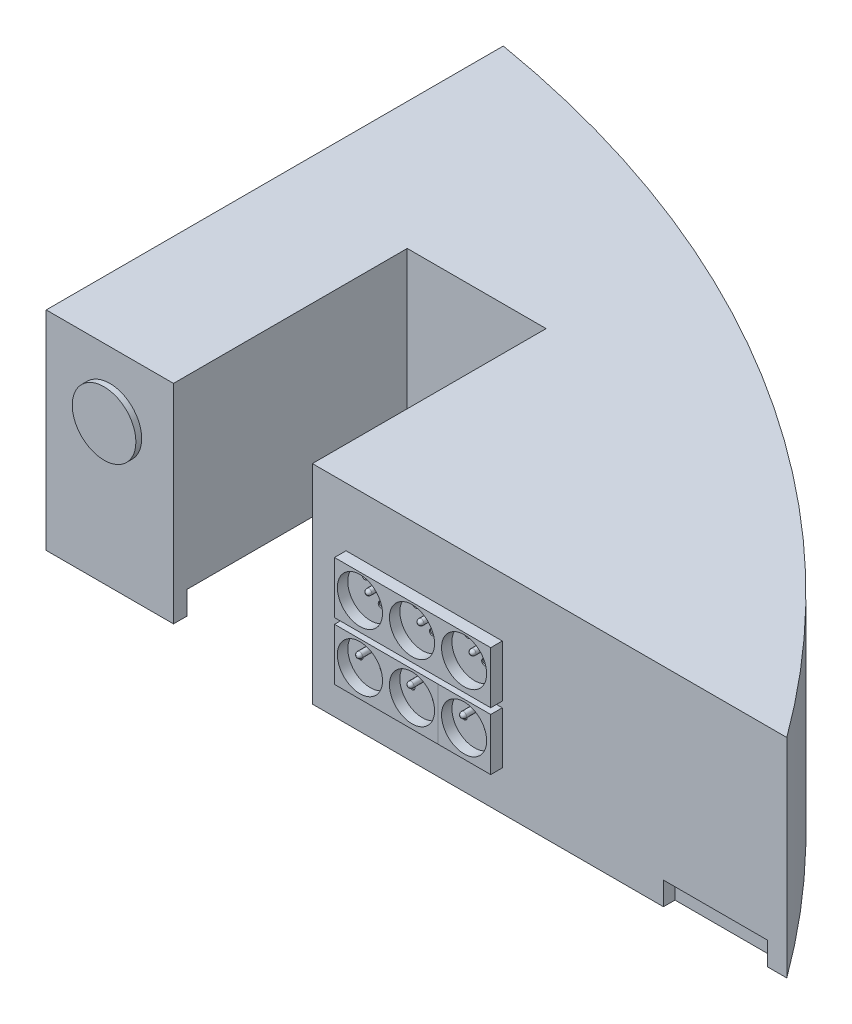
ISO-10303-21;
HEADER;
FILE_DESCRIPTION(('STEP AP214'),'2;1');
FILE_NAME('part.step','',(''),(''),'','','');
FILE_SCHEMA(('AUTOMOTIVE_DESIGN { 1 0 10303 214 1 1 1 1 }'));
ENDSEC;
DATA;
#1=APPLICATION_CONTEXT('core data for automotive mechanical design processes');
#2=APPLICATION_PROTOCOL_DEFINITION('international standard','automotive_design',2000,#1);
#3=PRODUCT_CONTEXT('',#1,'mechanical');
#4=PRODUCT('Part','Part','',(#3));
#5=PRODUCT_RELATED_PRODUCT_CATEGORY('part','',(#4));
#6=PRODUCT_DEFINITION_FORMATION('','',#4);
#7=PRODUCT_DEFINITION_CONTEXT('part definition',#1,'design');
#8=PRODUCT_DEFINITION('design','',#6,#7);
#9=PRODUCT_DEFINITION_SHAPE('','',#8);
#10=(LENGTH_UNIT() NAMED_UNIT(*) SI_UNIT(.MILLI.,.METRE.));
#11=(NAMED_UNIT(*) PLANE_ANGLE_UNIT() SI_UNIT($,.RADIAN.));
#12=(NAMED_UNIT(*) SI_UNIT($,.STERADIAN.) SOLID_ANGLE_UNIT());
#13=UNCERTAINTY_MEASURE_WITH_UNIT(LENGTH_MEASURE(1.E-05),#10,'distance_accuracy_value','');
#14=(GEOMETRIC_REPRESENTATION_CONTEXT(3) GLOBAL_UNCERTAINTY_ASSIGNED_CONTEXT((#13)) GLOBAL_UNIT_ASSIGNED_CONTEXT((#10,
#11,#12)) REPRESENTATION_CONTEXT('',''));
#15=CARTESIAN_POINT('',(0.,0.,0.));
#16=DIRECTION('',(0.,0.,1.));
#17=DIRECTION('',(1.,0.,0.));
#18=AXIS2_PLACEMENT_3D('',#15,#16,#17);
#19=CARTESIAN_POINT('',(-73.406,-20.7264,395.));
#20=DIRECTION('',(0.,1.,0.));
#21=DIRECTION('',(0.,0.,1.));
#22=AXIS2_PLACEMENT_3D('',#19,#20,#21);
#23=PLANE('',#22);
#24=DIRECTION('',(1.,0.,0.));
#25=VECTOR('',#24,1.);
#26=CARTESIAN_POINT('',(460.,-20.7264,385.));
#27=LINE('',#26,#25);
#28=CARTESIAN_POINT('',(460.,-20.7264,385.));
#29=VERTEX_POINT('',#28);
#30=CARTESIAN_POINT('',(550.,-20.7264,385.));
#31=VERTEX_POINT('',#30);
#32=EDGE_CURVE('E222',#29,#31,#27,.T.);
#33=ORIENTED_EDGE('',*,*,#32,.F.);
#34=DIRECTION('',(0.,0.,1.));
#35=VECTOR('',#34,1.);
#36=CARTESIAN_POINT('',(460.,-20.7264,385.));
#37=LINE('',#36,#35);
#38=CARTESIAN_POINT('',(460.,-20.7264,395.));
#39=VERTEX_POINT('',#38);
#40=EDGE_CURVE('E205',#29,#39,#37,.T.);
#41=ORIENTED_EDGE('',*,*,#40,.T.);
#42=DIRECTION('',(1.,0.,0.));
#43=VECTOR('',#42,1.);
#44=CARTESIAN_POINT('',(-73.406,-20.7264,395.));
#45=LINE('',#44,#43);
#46=CARTESIAN_POINT('',(156.594,-20.7264,395.));
#47=VERTEX_POINT('',#46);
#48=EDGE_CURVE('E639',#47,#39,#45,.T.);
#49=ORIENTED_EDGE('',*,*,#48,.F.);
#50=DIRECTION('',(0.,0.,1.));
#51=VECTOR('',#50,1.);
#52=CARTESIAN_POINT('',(156.594,-20.7264,193.));
#53=LINE('',#52,#51);
#54=CARTESIAN_POINT('',(156.594,-20.7264,383.501683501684));
#55=VERTEX_POINT('',#54);
#56=EDGE_CURVE('E625',#55,#47,#53,.T.);
#57=ORIENTED_EDGE('',*,*,#56,.F.);
#58=DIRECTION('',(1.,0.,0.));
#59=VECTOR('',#58,1.);
#60=CARTESIAN_POINT('',(246.594,-20.7264,383.501683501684));
#61=LINE('',#60,#59);
#62=CARTESIAN_POINT('',(542.997296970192,-20.7264,383.501683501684));
#63=VERTEX_POINT('',#62);
#64=EDGE_CURVE('E264',#55,#63,#61,.T.);
#65=ORIENTED_EDGE('',*,*,#64,.T.);
#66=CARTESIAN_POINT('',(-240.06712837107,-20.7264,986.014233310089));
#67=DIRECTION('',(0.,-1.,0.));
#68=DIRECTION('',(0.,0.,-1.));
#69=AXIS2_PLACEMENT_3D('',#66,#67,#68);
#70=CIRCLE('',#69,988.0340413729);
#71=CARTESIAN_POINT('',(-63.187647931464,-20.7264,13.9417481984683));
#72=VERTEX_POINT('',#71);
#73=EDGE_CURVE('E261',#72,#63,#70,.T.);
#74=ORIENTED_EDGE('',*,*,#73,.F.);
#75=DIRECTION('',(0.,0.,-1.));
#76=VECTOR('',#75,1.);
#77=CARTESIAN_POINT('',(-63.187647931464,-20.7264,-387.62272447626));
#78=LINE('',#77,#76);
#79=CARTESIAN_POINT('',(-63.187647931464,-20.7264,383.501683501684));
#80=VERTEX_POINT('',#79);
#81=EDGE_CURVE('E239',#80,#72,#78,.T.);
#82=ORIENTED_EDGE('',*,*,#81,.F.);
#83=CARTESIAN_POINT('',(36.594,-20.7264,383.501683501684));
#84=VERTEX_POINT('',#83);
#85=EDGE_CURVE('E247',#80,#84,#61,.T.);
#86=ORIENTED_EDGE('',*,*,#85,.T.);
#87=DIRECTION('',(0.,0.,1.));
#88=VECTOR('',#87,1.);
#89=CARTESIAN_POINT('',(36.594,-20.7264,193.));
#90=LINE('',#89,#88);
#91=CARTESIAN_POINT('',(36.594,-20.7264,395.));
#92=VERTEX_POINT('',#91);
#93=EDGE_CURVE('E589',#84,#92,#90,.T.);
#94=ORIENTED_EDGE('',*,*,#93,.T.);
#95=CARTESIAN_POINT('',(-73.406,-20.7264,395.));
#96=VERTEX_POINT('',#95);
#97=EDGE_CURVE('E635',#96,#92,#45,.T.);
#98=ORIENTED_EDGE('',*,*,#97,.F.);
#99=DIRECTION('',(0.,0.,-1.));
#100=VECTOR('',#99,1.);
#101=CARTESIAN_POINT('',(-73.406,-20.7264,395.));
#102=LINE('',#101,#100);
#103=CARTESIAN_POINT('',(-73.406,-20.7264,0.));
#104=VERTEX_POINT('',#103);
#105=EDGE_CURVE('E642',#96,#104,#102,.T.);
#106=ORIENTED_EDGE('',*,*,#105,.T.);
#107=CARTESIAN_POINT('',(-240.06712837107,-20.7264,986.014233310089));
#108=DIRECTION('',(0.,1.,0.));
#109=DIRECTION('',(0.,0.,1.));
#110=AXIS2_PLACEMENT_3D('',#107,#108,#109);
#111=CIRCLE('',#110,1000.);
#112=CARTESIAN_POINT('',(566.594,-20.7264,395.));
#113=VERTEX_POINT('',#112);
#114=EDGE_CURVE('E714',#104,#113,#111,.F.);
#115=ORIENTED_EDGE('',*,*,#114,.T.);
#116=CARTESIAN_POINT('',(550.,-20.7264,395.));
#117=VERTEX_POINT('',#116);
#118=EDGE_CURVE('E634',#117,#113,#45,.T.);
#119=ORIENTED_EDGE('',*,*,#118,.F.);
#120=DIRECTION('',(0.,0.,1.));
#121=VECTOR('',#120,1.);
#122=CARTESIAN_POINT('',(550.,-20.7264,385.));
#123=LINE('',#122,#121);
#124=EDGE_CURVE('E45',#31,#117,#123,.T.);
#125=ORIENTED_EDGE('',*,*,#124,.F.);
#126=EDGE_LOOP('',(#33,#41,#49,#57,#65,#74,#82,#86,#94,#98,#106,#115,#119,#125));
#127=FACE_BOUND('',#126,.T.);
#128=ADVANCED_FACE('F30',(#127),#23,.F.);
#129=CARTESIAN_POINT('',(156.594,-20.7264,193.));
#130=DIRECTION('',(1.,0.,0.));
#131=DIRECTION('',(0.,0.,-1.));
#132=AXIS2_PLACEMENT_3D('',#129,#130,#131);
#133=PLANE('',#132);
#134=DIRECTION('',(0.,-1.,0.));
#135=VECTOR('',#134,1.);
#136=CARTESIAN_POINT('',(156.594,-0.726400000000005,383.501683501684));
#137=LINE('',#136,#135);
#138=CARTESIAN_POINT('',(156.594,-0.726400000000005,383.501683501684));
#139=VERTEX_POINT('',#138);
#140=EDGE_CURVE('E272',#139,#55,#137,.T.);
#141=ORIENTED_EDGE('',*,*,#140,.T.);
#142=ORIENTED_EDGE('',*,*,#56,.T.);
#143=DIRECTION('',(0.,1.,0.));
#144=VECTOR('',#143,1.);
#145=CARTESIAN_POINT('',(156.594,-20.7264,395.));
#146=LINE('',#145,#144);
#147=CARTESIAN_POINT('',(156.594,159.2736,395.));
#148=VERTEX_POINT('',#147);
#149=EDGE_CURVE('E620',#47,#148,#146,.T.);
#150=ORIENTED_EDGE('',*,*,#149,.T.);
#151=DIRECTION('',(0.,0.,1.));
#152=VECTOR('',#151,1.);
#153=CARTESIAN_POINT('',(156.594,159.2736,193.));
#154=LINE('',#153,#152);
#155=CARTESIAN_POINT('',(156.594,159.2736,193.));
#156=VERTEX_POINT('',#155);
#157=EDGE_CURVE('E609',#156,#148,#154,.T.);
#158=ORIENTED_EDGE('',*,*,#157,.F.);
#159=DIRECTION('',(0.,1.,0.));
#160=VECTOR('',#159,1.);
#161=CARTESIAN_POINT('',(156.594,-20.7264,193.));
#162=LINE('',#161,#160);
#163=CARTESIAN_POINT('',(156.594,-0.726400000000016,193.));
#164=VERTEX_POINT('',#163);
#165=EDGE_CURVE('E605',#164,#156,#162,.T.);
#166=ORIENTED_EDGE('',*,*,#165,.F.);
#167=DIRECTION('',(0.,0.,1.));
#168=VECTOR('',#167,1.);
#169=CARTESIAN_POINT('',(156.594,-0.726400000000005,-387.62272447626));
#170=LINE('',#169,#168);
#171=EDGE_CURVE('E53',#164,#139,#170,.T.);
#172=ORIENTED_EDGE('',*,*,#171,.T.);
#173=EDGE_LOOP('',(#141,#142,#150,#158,#166,#172));
#174=FACE_BOUND('',#173,.T.);
#175=ADVANCED_FACE('F441',(#174),#133,.F.);
#176=CARTESIAN_POINT('',(36.594,159.2736,193.));
#177=DIRECTION('',(-1.,0.,0.));
#178=DIRECTION('',(0.,-1.,0.));
#179=AXIS2_PLACEMENT_3D('',#176,#177,#178);
#180=PLANE('',#179);
#181=DIRECTION('',(0.,-1.,0.));
#182=VECTOR('',#181,1.);
#183=CARTESIAN_POINT('',(36.594,-0.726400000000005,383.501683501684));
#184=LINE('',#183,#182);
#185=CARTESIAN_POINT('',(36.594,-0.726400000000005,383.501683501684));
#186=VERTEX_POINT('',#185);
#187=EDGE_CURVE('E270',#186,#84,#184,.T.);
#188=ORIENTED_EDGE('',*,*,#187,.F.);
#189=DIRECTION('',(0.,0.,1.));
#190=VECTOR('',#189,1.);
#191=CARTESIAN_POINT('',(36.594,-0.726400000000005,-387.62272447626));
#192=LINE('',#191,#190);
#193=CARTESIAN_POINT('',(36.594,-0.726400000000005,193.));
#194=VERTEX_POINT('',#193);
#195=EDGE_CURVE('E256',#194,#186,#192,.T.);
#196=ORIENTED_EDGE('',*,*,#195,.F.);
#197=DIRECTION('',(0.,-1.,0.));
#198=VECTOR('',#197,1.);
#199=CARTESIAN_POINT('',(36.594,159.2736,193.));
#200=LINE('',#199,#198);
#201=CARTESIAN_POINT('',(36.594,159.2736,193.));
#202=VERTEX_POINT('',#201);
#203=EDGE_CURVE('E607',#202,#194,#200,.T.);
#204=ORIENTED_EDGE('',*,*,#203,.F.);
#205=DIRECTION('',(0.,0.,1.));
#206=VECTOR('',#205,1.);
#207=CARTESIAN_POINT('',(36.594,159.2736,193.));
#208=LINE('',#207,#206);
#209=CARTESIAN_POINT('',(36.594,159.2736,395.));
#210=VERTEX_POINT('',#209);
#211=EDGE_CURVE('E611',#202,#210,#208,.T.);
#212=ORIENTED_EDGE('',*,*,#211,.T.);
#213=DIRECTION('',(0.,-1.,0.));
#214=VECTOR('',#213,1.);
#215=CARTESIAN_POINT('',(36.594,159.2736,395.));
#216=LINE('',#215,#214);
#217=EDGE_CURVE('E618',#210,#92,#216,.T.);
#218=ORIENTED_EDGE('',*,*,#217,.T.);
#219=ORIENTED_EDGE('',*,*,#93,.F.);
#220=EDGE_LOOP('',(#188,#196,#204,#212,#218,#219));
#221=FACE_BOUND('',#220,.T.);
#222=ADVANCED_FACE('F446',(#221),#180,.F.);
#223=CARTESIAN_POINT('',(156.594,159.2736,193.));
#224=DIRECTION('',(0.,0.,-1.));
#225=DIRECTION('',(-1.,0.,0.));
#226=AXIS2_PLACEMENT_3D('',#223,#224,#225);
#227=PLANE('',#226);
#228=DIRECTION('',(1.,0.,0.));
#229=VECTOR('',#228,1.);
#230=CARTESIAN_POINT('',(246.594,-0.726400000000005,193.));
#231=LINE('',#230,#229);
#232=EDGE_CURVE('E254',#194,#164,#231,.T.);
#233=ORIENTED_EDGE('',*,*,#232,.T.);
#234=ORIENTED_EDGE('',*,*,#165,.T.);
#235=DIRECTION('',(-1.,0.,0.));
#236=VECTOR('',#235,1.);
#237=CARTESIAN_POINT('',(156.594,159.2736,193.));
#238=LINE('',#237,#236);
#239=EDGE_CURVE('E614',#156,#202,#238,.T.);
#240=ORIENTED_EDGE('',*,*,#239,.T.);
#241=ORIENTED_EDGE('',*,*,#203,.T.);
#242=EDGE_LOOP('',(#233,#234,#240,#241));
#243=FACE_BOUND('',#242,.T.);
#244=ADVANCED_FACE('F577',(#243),#227,.F.);
#245=CARTESIAN_POINT('',(-73.406,159.2736,395.));
#246=DIRECTION('',(0.,0.,1.));
#247=DIRECTION('',(1.,0.,0.));
#248=AXIS2_PLACEMENT_3D('',#245,#246,#247);
#249=PLANE('',#248);
#250=ORIENTED_EDGE('',*,*,#217,.F.);
#251=DIRECTION('',(-1.,0.,0.));
#252=VECTOR('',#251,1.);
#253=CARTESIAN_POINT('',(566.594,159.2736,395.));
#254=LINE('',#253,#252);
#255=CARTESIAN_POINT('',(-73.406,159.2736,395.));
#256=VERTEX_POINT('',#255);
#257=EDGE_CURVE('E632',#210,#256,#254,.T.);
#258=ORIENTED_EDGE('',*,*,#257,.T.);
#259=DIRECTION('',(0.,-1.,0.));
#260=VECTOR('',#259,1.);
#261=CARTESIAN_POINT('',(-73.406,159.2736,395.));
#262=LINE('',#261,#260);
#263=EDGE_CURVE('E631',#256,#96,#262,.T.);
#264=ORIENTED_EDGE('',*,*,#263,.T.);
#265=ORIENTED_EDGE('',*,*,#97,.T.);
#266=EDGE_LOOP('',(#250,#258,#264,#265));
#267=FACE_BOUND('',#266,.T.);
#268=CARTESIAN_POINT('',(-18.406,104.2736,395.));
#269=DIRECTION('',(0.,0.,1.));
#270=DIRECTION('',(1.,0.,0.));
#271=AXIS2_PLACEMENT_3D('',#268,#269,#270);
#272=CIRCLE('',#271,27.5);
#273=CARTESIAN_POINT('',(9.09400000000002,104.2736,395.));
#274=VERTEX_POINT('',#273);
#275=EDGE_CURVE('E269',#274,#274,#272,.T.);
#276=ORIENTED_EDGE('',*,*,#275,.F.);
#277=EDGE_LOOP('',(#276));
#278=FACE_BOUND('',#277,.T.);
#279=ADVANCED_FACE('F451',(#267,#278),#249,.T.);
#280=CARTESIAN_POINT('',(207.71720631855,87.3459396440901,396.));
#281=DIRECTION('',(0.,0.,1.));
#282=DIRECTION('',(1.,0.,0.));
#283=AXIS2_PLACEMENT_3D('',#280,#281,#282);
#284=PLANE('',#283);
#285=CARTESIAN_POINT('',(207.71720631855,87.3459396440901,396.));
#286=DIRECTION('',(0.,0.,1.));
#287=DIRECTION('',(1.,0.,0.));
#288=AXIS2_PLACEMENT_3D('',#285,#286,#287);
#289=CIRCLE('',#288,19.5);
#290=CARTESIAN_POINT('',(227.21720631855,87.3459396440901,396.));
#291=VERTEX_POINT('',#290);
#292=EDGE_CURVE('E898',#291,#291,#289,.T.);
#293=ORIENTED_EDGE('',*,*,#292,.T.);
#294=EDGE_LOOP('',(#293));
#295=FACE_BOUND('',#294,.T.);
#296=CARTESIAN_POINT('',(203.026104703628,98.5412132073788,396.));
#297=DIRECTION('',(0.,0.,1.));
#298=DIRECTION('',(1.,0.,0.));
#299=AXIS2_PLACEMENT_3D('',#296,#297,#298);
#300=CIRCLE('',#299,2.5);
#301=CARTESIAN_POINT('',(205.526104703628,98.5412132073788,396.));
#302=VERTEX_POINT('',#301);
#303=EDGE_CURVE('E321',#302,#302,#300,.T.);
#304=ORIENTED_EDGE('',*,*,#303,.F.);
#305=EDGE_LOOP('',(#304));
#306=FACE_BOUND('',#305,.T.);
#307=CARTESIAN_POINT('',(217.032579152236,84.2647054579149,396.));
#308=DIRECTION('',(0.,0.,1.));
#309=DIRECTION('',(1.,0.,0.));
#310=AXIS2_PLACEMENT_3D('',#307,#308,#309);
#311=CIRCLE('',#310,2.5);
#312=CARTESIAN_POINT('',(219.532579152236,84.2647054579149,396.));
#313=VERTEX_POINT('',#312);
#314=EDGE_CURVE('E315',#313,#313,#311,.T.);
#315=ORIENTED_EDGE('',*,*,#314,.F.);
#316=EDGE_LOOP('',(#315));
#317=FACE_BOUND('',#316,.T.);
#318=CARTESIAN_POINT('',(215.988210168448,98.2052185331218,396.));
#319=DIRECTION('',(0.,0.,1.));
#320=DIRECTION('',(1.,0.,0.));
#321=AXIS2_PLACEMENT_3D('',#318,#319,#320);
#322=CIRCLE('',#321,2.5);
#323=CARTESIAN_POINT('',(218.488210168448,98.2052185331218,396.));
#324=VERTEX_POINT('',#323);
#325=EDGE_CURVE('E282',#324,#324,#322,.T.);
#326=ORIENTED_EDGE('',*,*,#325,.F.);
#327=EDGE_LOOP('',(#326));
#328=FACE_BOUND('',#327,.T.);
#329=ADVANCED_FACE('F516',(#295,#306,#317,#328),#284,.T.);
#330=CARTESIAN_POINT('',(252.71720631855,87.3459396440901,396.));
#331=DIRECTION('',(0.,0.,1.));
#332=DIRECTION('',(1.,0.,0.));
#333=AXIS2_PLACEMENT_3D('',#330,#331,#332);
#334=PLANE('',#333);
#335=CARTESIAN_POINT('',(252.71720631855,87.3459396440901,396.));
#336=DIRECTION('',(0.,0.,1.));
#337=DIRECTION('',(1.,0.,0.));
#338=AXIS2_PLACEMENT_3D('',#335,#336,#337);
#339=CIRCLE('',#338,19.5);
#340=CARTESIAN_POINT('',(272.21720631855,87.3459396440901,396.));
#341=VERTEX_POINT('',#340);
#342=EDGE_CURVE('E904',#341,#341,#339,.T.);
#343=ORIENTED_EDGE('',*,*,#342,.T.);
#344=EDGE_LOOP('',(#343));
#345=FACE_BOUND('',#344,.T.);
#346=CARTESIAN_POINT('',(246.504457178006,99.2141015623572,396.));
#347=DIRECTION('',(0.,0.,1.));
#348=DIRECTION('',(1.,0.,0.));
#349=AXIS2_PLACEMENT_3D('',#346,#347,#348);
#350=CIRCLE('',#349,2.5);
#351=CARTESIAN_POINT('',(249.004457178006,99.2141015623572,396.));
#352=VERTEX_POINT('',#351);
#353=EDGE_CURVE('E309',#352,#352,#350,.T.);
#354=ORIENTED_EDGE('',*,*,#353,.F.);
#355=EDGE_LOOP('',(#354));
#356=FACE_BOUND('',#355,.T.);
#357=CARTESIAN_POINT('',(261.268654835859,85.7226795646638,396.));
#358=DIRECTION('',(0.,0.,1.));
#359=DIRECTION('',(1.,0.,0.));
#360=AXIS2_PLACEMENT_3D('',#357,#358,#359);
#361=CIRCLE('',#360,2.50000000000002);
#362=CARTESIAN_POINT('',(263.768654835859,85.7226795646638,396.));
#363=VERTEX_POINT('',#362);
#364=EDGE_CURVE('E303',#363,#363,#361,.T.);
#365=ORIENTED_EDGE('',*,*,#364,.F.);
#366=EDGE_LOOP('',(#365));
#367=FACE_BOUND('',#366,.T.);
#368=CARTESIAN_POINT('',(260.988210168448,98.2052185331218,396.));
#369=DIRECTION('',(0.,0.,1.));
#370=DIRECTION('',(1.,0.,0.));
#371=AXIS2_PLACEMENT_3D('',#368,#369,#370);
#372=CIRCLE('',#371,2.50000000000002);
#373=CARTESIAN_POINT('',(263.488210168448,98.2052185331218,396.));
#374=VERTEX_POINT('',#373);
#375=EDGE_CURVE('E287',#374,#374,#372,.T.);
#376=ORIENTED_EDGE('',*,*,#375,.F.);
#377=EDGE_LOOP('',(#376));
#378=FACE_BOUND('',#377,.T.);
#379=ADVANCED_FACE('F503',(#345,#356,#367,#378),#334,.T.);
#380=CARTESIAN_POINT('',(297.71720631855,87.3459396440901,396.));
#381=DIRECTION('',(0.,0.,1.));
#382=DIRECTION('',(1.,0.,0.));
#383=AXIS2_PLACEMENT_3D('',#380,#381,#382);
#384=PLANE('',#383);
#385=CARTESIAN_POINT('',(297.71720631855,87.3459396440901,396.));
#386=DIRECTION('',(0.,0.,1.));
#387=DIRECTION('',(1.,0.,0.));
#388=AXIS2_PLACEMENT_3D('',#385,#386,#387);
#389=CIRCLE('',#388,19.5);
#390=CARTESIAN_POINT('',(317.21720631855,87.3459396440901,396.));
#391=VERTEX_POINT('',#390);
#392=EDGE_CURVE('E664',#391,#391,#389,.T.);
#393=ORIENTED_EDGE('',*,*,#392,.T.);
#394=EDGE_LOOP('',(#393));
#395=FACE_BOUND('',#394,.T.);
#396=CARTESIAN_POINT('',(291.504457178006,99.2141015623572,396.));
#397=DIRECTION('',(0.,0.,1.));
#398=DIRECTION('',(1.,0.,0.));
#399=AXIS2_PLACEMENT_3D('',#396,#397,#398);
#400=CIRCLE('',#399,2.50000000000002);
#401=CARTESIAN_POINT('',(294.004457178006,99.2141015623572,396.));
#402=VERTEX_POINT('',#401);
#403=EDGE_CURVE('E297',#402,#402,#400,.T.);
#404=ORIENTED_EDGE('',*,*,#403,.F.);
#405=EDGE_LOOP('',(#404));
#406=FACE_BOUND('',#405,.T.);
#407=CARTESIAN_POINT('',(306.443393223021,85.9222036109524,396.));
#408=DIRECTION('',(0.,0.,1.));
#409=DIRECTION('',(1.,0.,0.));
#410=AXIS2_PLACEMENT_3D('',#407,#408,#409);
#411=CIRCLE('',#410,2.50000000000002);
#412=CARTESIAN_POINT('',(308.943393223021,85.9222036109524,396.));
#413=VERTEX_POINT('',#412);
#414=EDGE_CURVE('E293',#413,#413,#411,.T.);
#415=ORIENTED_EDGE('',*,*,#414,.F.);
#416=EDGE_LOOP('',(#415));
#417=FACE_BOUND('',#416,.T.);
#418=CARTESIAN_POINT('',(305.988210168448,98.2052185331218,396.));
#419=DIRECTION('',(0.,0.,1.));
#420=DIRECTION('',(1.,0.,0.));
#421=AXIS2_PLACEMENT_3D('',#418,#419,#420);
#422=CIRCLE('',#421,2.50000000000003);
#423=CARTESIAN_POINT('',(308.488210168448,98.2052185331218,396.));
#424=VERTEX_POINT('',#423);
#425=EDGE_CURVE('E290',#424,#424,#422,.T.);
#426=ORIENTED_EDGE('',*,*,#425,.F.);
#427=EDGE_LOOP('',(#426));
#428=FACE_BOUND('',#427,.T.);
#429=ADVANCED_FACE('F493',(#395,#406,#417,#428),#384,.T.);
#430=CARTESIAN_POINT('',(207.71720631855,37.0576901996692,396.));
#431=DIRECTION('',(0.,0.,1.));
#432=DIRECTION('',(1.,0.,0.));
#433=AXIS2_PLACEMENT_3D('',#430,#431,#432);
#434=PLANE('',#433);
#435=CARTESIAN_POINT('',(207.71720631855,37.0576901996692,396.));
#436=DIRECTION('',(0.,0.,1.));
#437=DIRECTION('',(1.,0.,0.));
#438=AXIS2_PLACEMENT_3D('',#435,#436,#437);
#439=CIRCLE('',#438,19.5);
#440=CARTESIAN_POINT('',(227.21720631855,37.0576901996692,396.));
#441=VERTEX_POINT('',#440);
#442=EDGE_CURVE('E893',#441,#441,#439,.T.);
#443=ORIENTED_EDGE('',*,*,#442,.T.);
#444=EDGE_LOOP('',(#443));
#445=FACE_BOUND('',#444,.T.);
#446=CARTESIAN_POINT('',(198.71720631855,36.5338250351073,396.));
#447=DIRECTION('',(0.,0.,1.));
#448=DIRECTION('',(1.,0.,0.));
#449=AXIS2_PLACEMENT_3D('',#446,#447,#448);
#450=CIRCLE('',#449,2.5);
#451=CARTESIAN_POINT('',(201.21720631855,36.5338250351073,396.));
#452=VERTEX_POINT('',#451);
#453=EDGE_CURVE('E366',#452,#452,#450,.T.);
#454=ORIENTED_EDGE('',*,*,#453,.F.);
#455=EDGE_LOOP('',(#454));
#456=FACE_BOUND('',#455,.T.);
#457=CARTESIAN_POINT('',(218.71720631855,36.5338250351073,396.));
#458=DIRECTION('',(0.,0.,1.));
#459=DIRECTION('',(1.,0.,0.));
#460=AXIS2_PLACEMENT_3D('',#457,#458,#459);
#461=CIRCLE('',#460,2.5);
#462=CARTESIAN_POINT('',(221.21720631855,36.5338250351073,396.));
#463=VERTEX_POINT('',#462);
#464=EDGE_CURVE('E360',#463,#463,#461,.T.);
#465=ORIENTED_EDGE('',*,*,#464,.F.);
#466=EDGE_LOOP('',(#465));
#467=FACE_BOUND('',#466,.T.);
#468=CARTESIAN_POINT('',(207.915865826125,47.0479071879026,396.));
#469=DIRECTION('',(0.,0.,1.));
#470=DIRECTION('',(1.,0.,0.));
#471=AXIS2_PLACEMENT_3D('',#468,#469,#470);
#472=CIRCLE('',#471,2.5);
#473=CARTESIAN_POINT('',(210.415865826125,47.0479071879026,396.));
#474=VERTEX_POINT('',#473);
#475=EDGE_CURVE('E327',#474,#474,#472,.T.);
#476=ORIENTED_EDGE('',*,*,#475,.F.);
#477=EDGE_LOOP('',(#476));
#478=FACE_BOUND('',#477,.T.);
#479=ADVANCED_FACE('F490',(#445,#456,#467,#478),#434,.T.);
#480=CARTESIAN_POINT('',(252.71720631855,37.0576901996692,396.));
#481=DIRECTION('',(0.,0.,1.));
#482=DIRECTION('',(1.,0.,0.));
#483=AXIS2_PLACEMENT_3D('',#480,#481,#482);
#484=PLANE('',#483);
#485=CARTESIAN_POINT('',(252.71720631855,37.0576901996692,396.));
#486=DIRECTION('',(0.,0.,1.));
#487=DIRECTION('',(1.,0.,0.));
#488=AXIS2_PLACEMENT_3D('',#485,#486,#487);
#489=CIRCLE('',#488,19.5);
#490=CARTESIAN_POINT('',(272.21720631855,37.0576901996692,396.));
#491=VERTEX_POINT('',#490);
#492=EDGE_CURVE('E886',#491,#491,#489,.T.);
#493=ORIENTED_EDGE('',*,*,#492,.T.);
#494=EDGE_LOOP('',(#493));
#495=FACE_BOUND('',#494,.T.);
#496=CARTESIAN_POINT('',(243.71720631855,36.5338250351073,396.));
#497=DIRECTION('',(0.,0.,1.));
#498=DIRECTION('',(1.,0.,0.));
#499=AXIS2_PLACEMENT_3D('',#496,#497,#498);
#500=CIRCLE('',#499,2.5);
#501=CARTESIAN_POINT('',(246.21720631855,36.5338250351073,396.));
#502=VERTEX_POINT('',#501);
#503=EDGE_CURVE('E354',#502,#502,#500,.T.);
#504=ORIENTED_EDGE('',*,*,#503,.F.);
#505=EDGE_LOOP('',(#504));
#506=FACE_BOUND('',#505,.T.);
#507=CARTESIAN_POINT('',(263.71720631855,36.5338250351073,396.));
#508=DIRECTION('',(0.,0.,1.));
#509=DIRECTION('',(1.,0.,0.));
#510=AXIS2_PLACEMENT_3D('',#507,#508,#509);
#511=CIRCLE('',#510,2.50000000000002);
#512=CARTESIAN_POINT('',(266.21720631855,36.5338250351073,396.));
#513=VERTEX_POINT('',#512);
#514=EDGE_CURVE('E348',#513,#513,#511,.T.);
#515=ORIENTED_EDGE('',*,*,#514,.F.);
#516=EDGE_LOOP('',(#515));
#517=FACE_BOUND('',#516,.T.);
#518=CARTESIAN_POINT('',(252.333937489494,47.0479071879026,396.));
#519=DIRECTION('',(0.,0.,1.));
#520=DIRECTION('',(1.,0.,0.));
#521=AXIS2_PLACEMENT_3D('',#518,#519,#520);
#522=CIRCLE('',#521,2.50000000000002);
#523=CARTESIAN_POINT('',(254.833937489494,47.0479071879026,396.));
#524=VERTEX_POINT('',#523);
#525=EDGE_CURVE('E332',#524,#524,#522,.T.);
#526=ORIENTED_EDGE('',*,*,#525,.F.);
#527=EDGE_LOOP('',(#526));
#528=FACE_BOUND('',#527,.T.);
#529=ADVANCED_FACE('F492',(#495,#506,#517,#528),#484,.T.);
#530=CARTESIAN_POINT('',(297.71720631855,37.0576901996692,396.));
#531=DIRECTION('',(0.,0.,1.));
#532=DIRECTION('',(1.,0.,0.));
#533=AXIS2_PLACEMENT_3D('',#530,#531,#532);
#534=PLANE('',#533);
#535=CARTESIAN_POINT('',(297.71720631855,37.0576901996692,396.));
#536=DIRECTION('',(0.,0.,1.));
#537=DIRECTION('',(1.,0.,0.));
#538=AXIS2_PLACEMENT_3D('',#535,#536,#537);
#539=CIRCLE('',#538,19.5);
#540=CARTESIAN_POINT('',(317.21720631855,37.0576901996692,396.));
#541=VERTEX_POINT('',#540);
#542=EDGE_CURVE('E392',#541,#541,#539,.T.);
#543=ORIENTED_EDGE('',*,*,#542,.T.);
#544=EDGE_LOOP('',(#543));
#545=FACE_BOUND('',#544,.T.);
#546=CARTESIAN_POINT('',(288.71720631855,36.5338250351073,396.));
#547=DIRECTION('',(0.,0.,1.));
#548=DIRECTION('',(1.,0.,0.));
#549=AXIS2_PLACEMENT_3D('',#546,#547,#548);
#550=CIRCLE('',#549,2.50000000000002);
#551=CARTESIAN_POINT('',(291.21720631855,36.5338250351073,396.));
#552=VERTEX_POINT('',#551);
#553=EDGE_CURVE('E342',#552,#552,#550,.T.);
#554=ORIENTED_EDGE('',*,*,#553,.F.);
#555=EDGE_LOOP('',(#554));
#556=FACE_BOUND('',#555,.T.);
#557=CARTESIAN_POINT('',(308.71720631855,36.5338250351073,396.));
#558=DIRECTION('',(0.,0.,1.));
#559=DIRECTION('',(1.,0.,0.));
#560=AXIS2_PLACEMENT_3D('',#557,#558,#559);
#561=CIRCLE('',#560,2.50000000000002);
#562=CARTESIAN_POINT('',(311.21720631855,36.5338250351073,396.));
#563=VERTEX_POINT('',#562);
#564=EDGE_CURVE('E338',#563,#563,#561,.T.);
#565=ORIENTED_EDGE('',*,*,#564,.F.);
#566=EDGE_LOOP('',(#565));
#567=FACE_BOUND('',#566,.T.);
#568=CARTESIAN_POINT('',(297.774114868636,47.0479071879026,396.));
#569=DIRECTION('',(0.,0.,1.));
#570=DIRECTION('',(1.,0.,0.));
#571=AXIS2_PLACEMENT_3D('',#568,#569,#570);
#572=CIRCLE('',#571,2.50000000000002);
#573=CARTESIAN_POINT('',(300.274114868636,47.0479071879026,396.));
#574=VERTEX_POINT('',#573);
#575=EDGE_CURVE('E335',#574,#574,#572,.T.);
#576=ORIENTED_EDGE('',*,*,#575,.F.);
#577=EDGE_LOOP('',(#576));
#578=FACE_BOUND('',#577,.T.);
#579=ADVANCED_FACE('F500',(#545,#556,#567,#578),#534,.T.);
#580=DIRECTION('',(0.,-1.,0.));
#581=VECTOR('',#580,1.);
#582=CARTESIAN_POINT('',(460.,-20.7264,395.));
#583=LINE('',#582,#581);
#584=CARTESIAN_POINT('',(460.,-0.726400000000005,395.));
#585=VERTEX_POINT('',#584);
#586=EDGE_CURVE('E211',#585,#39,#583,.T.);
#587=ORIENTED_EDGE('',*,*,#586,.F.);
#588=DIRECTION('',(-1.,0.,0.));
#589=VECTOR('',#588,1.);
#590=CARTESIAN_POINT('',(460.,-0.726400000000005,395.));
#591=LINE('',#590,#589);
#592=CARTESIAN_POINT('',(550.,-0.726400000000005,395.));
#593=VERTEX_POINT('',#592);
#594=EDGE_CURVE('E224',#593,#585,#591,.T.);
#595=ORIENTED_EDGE('',*,*,#594,.F.);
#596=DIRECTION('',(0.,1.,0.));
#597=VECTOR('',#596,1.);
#598=CARTESIAN_POINT('',(550.,-20.7264,395.));
#599=LINE('',#598,#597);
#600=EDGE_CURVE('E233',#117,#593,#599,.T.);
#601=ORIENTED_EDGE('',*,*,#600,.F.);
#602=ORIENTED_EDGE('',*,*,#118,.T.);
#603=DIRECTION('',(0.,1.,0.));
#604=VECTOR('',#603,1.);
#605=CARTESIAN_POINT('',(566.594,-20.7264,395.));
#606=LINE('',#605,#604);
#607=CARTESIAN_POINT('',(566.594,159.2736,395.));
#608=VERTEX_POINT('',#607);
#609=EDGE_CURVE('E638',#113,#608,#606,.T.);
#610=ORIENTED_EDGE('',*,*,#609,.T.);
#611=EDGE_CURVE('E628',#608,#148,#254,.T.);
#612=ORIENTED_EDGE('',*,*,#611,.T.);
#613=ORIENTED_EDGE('',*,*,#149,.F.);
#614=ORIENTED_EDGE('',*,*,#48,.T.);
#615=EDGE_LOOP('',(#587,#595,#601,#602,#610,#612,#613,#614));
#616=FACE_BOUND('',#615,.T.);
#617=DIRECTION('',(-1.,0.,0.));
#618=VECTOR('',#617,1.);
#619=CARTESIAN_POINT('',(361.594,63.5612948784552,395.));
#620=LINE('',#619,#618);
#621=CARTESIAN_POINT('',(320.71720631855,63.5612948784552,395.));
#622=VERTEX_POINT('',#621);
#623=CARTESIAN_POINT('',(185.71720631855,63.5612948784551,395.));
#624=VERTEX_POINT('',#623);
#625=EDGE_CURVE('E682',#622,#624,#620,.T.);
#626=ORIENTED_EDGE('',*,*,#625,.T.);
#627=DIRECTION('',(0.,1.,0.));
#628=VECTOR('',#627,1.);
#629=CARTESIAN_POINT('',(185.71720631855,-279.152905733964,395.));
#630=LINE('',#629,#628);
#631=CARTESIAN_POINT('',(185.71720631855,108.561294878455,395.));
#632=VERTEX_POINT('',#631);
#633=EDGE_CURVE('E687',#624,#632,#630,.T.);
#634=ORIENTED_EDGE('',*,*,#633,.T.);
#635=DIRECTION('',(-1.,0.,0.));
#636=VECTOR('',#635,1.);
#637=CARTESIAN_POINT('',(361.594,108.561294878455,395.));
#638=LINE('',#637,#636);
#639=CARTESIAN_POINT('',(320.71720631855,108.561294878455,395.));
#640=VERTEX_POINT('',#639);
#641=EDGE_CURVE('E699',#640,#632,#638,.T.);
#642=ORIENTED_EDGE('',*,*,#641,.F.);
#643=DIRECTION('',(0.,-1.,0.));
#644=VECTOR('',#643,1.);
#645=CARTESIAN_POINT('',(320.71720631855,-279.152905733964,395.));
#646=LINE('',#645,#644);
#647=EDGE_CURVE('E697',#640,#622,#646,.T.);
#648=ORIENTED_EDGE('',*,*,#647,.T.);
#649=EDGE_LOOP('',(#626,#634,#642,#648));
#650=FACE_BOUND('',#649,.T.);
#651=DIRECTION('',(0.,1.,0.));
#652=VECTOR('',#651,1.);
#653=CARTESIAN_POINT('',(185.71720631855,-279.152905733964,395.));
#654=LINE('',#653,#652);
#655=CARTESIAN_POINT('',(185.71720631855,13.5612948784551,395.));
#656=VERTEX_POINT('',#655);
#657=CARTESIAN_POINT('',(185.71720631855,58.5612948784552,395.));
#658=VERTEX_POINT('',#657);
#659=EDGE_CURVE('E663',#656,#658,#654,.T.);
#660=ORIENTED_EDGE('',*,*,#659,.T.);
#661=DIRECTION('',(-1.,0.,0.));
#662=VECTOR('',#661,1.);
#663=CARTESIAN_POINT('',(361.594,58.5612948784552,395.));
#664=LINE('',#663,#662);
#665=CARTESIAN_POINT('',(320.71720631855,58.5612948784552,395.));
#666=VERTEX_POINT('',#665);
#667=EDGE_CURVE('E660',#666,#658,#664,.T.);
#668=ORIENTED_EDGE('',*,*,#667,.F.);
#669=DIRECTION('',(0.,-1.,0.));
#670=VECTOR('',#669,1.);
#671=CARTESIAN_POINT('',(320.71720631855,-279.152905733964,395.));
#672=LINE('',#671,#670);
#673=CARTESIAN_POINT('',(320.71720631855,13.5612948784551,395.));
#674=VERTEX_POINT('',#673);
#675=EDGE_CURVE('E651',#666,#674,#672,.T.);
#676=ORIENTED_EDGE('',*,*,#675,.T.);
#677=DIRECTION('',(1.,0.,0.));
#678=VECTOR('',#677,1.);
#679=CARTESIAN_POINT('',(361.594,13.5612948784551,395.));
#680=LINE('',#679,#678);
#681=EDGE_CURVE('E666',#656,#674,#680,.T.);
#682=ORIENTED_EDGE('',*,*,#681,.F.);
#683=EDGE_LOOP('',(#660,#668,#676,#682));
#684=FACE_BOUND('',#683,.T.);
#685=ADVANCED_FACE('F461',(#616,#650,#684),#249,.T.);
#686=CARTESIAN_POINT('',(566.594,159.2736,395.));
#687=DIRECTION('',(0.,-1.,0.));
#688=DIRECTION('',(1.,0.,0.));
#689=AXIS2_PLACEMENT_3D('',#686,#687,#688);
#690=PLANE('',#689);
#691=ORIENTED_EDGE('',*,*,#611,.F.);
#692=CARTESIAN_POINT('',(-240.06712837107,159.2736,986.014233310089));
#693=DIRECTION('',(0.,-1.,0.));
#694=DIRECTION('',(1.,0.,0.));
#695=AXIS2_PLACEMENT_3D('',#692,#693,#694);
#696=CIRCLE('',#695,1000.);
#697=CARTESIAN_POINT('',(-73.4059999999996,159.2736,1.11022302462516E-13));
#698=VERTEX_POINT('',#697);
#699=EDGE_CURVE('E621',#608,#698,#696,.F.);
#700=ORIENTED_EDGE('',*,*,#699,.T.);
#701=DIRECTION('',(0.,0.,-1.));
#702=VECTOR('',#701,1.);
#703=CARTESIAN_POINT('',(-73.406,159.2736,395.));
#704=LINE('',#703,#702);
#705=EDGE_CURVE('E414',#256,#698,#704,.T.);
#706=ORIENTED_EDGE('',*,*,#705,.F.);
#707=ORIENTED_EDGE('',*,*,#257,.F.);
#708=ORIENTED_EDGE('',*,*,#211,.F.);
#709=ORIENTED_EDGE('',*,*,#239,.F.);
#710=ORIENTED_EDGE('',*,*,#157,.T.);
#711=EDGE_LOOP('',(#691,#700,#706,#707,#708,#709,#710));
#712=FACE_BOUND('',#711,.T.);
#713=ADVANCED_FACE('F457',(#712),#690,.F.);
#714=CARTESIAN_POINT('',(-73.406,159.2736,395.));
#715=DIRECTION('',(1.,0.,0.));
#716=DIRECTION('',(0.,1.,0.));
#717=AXIS2_PLACEMENT_3D('',#714,#715,#716);
#718=PLANE('',#717);
#719=DIRECTION('',(0.,-1.,0.));
#720=VECTOR('',#719,1.);
#721=CARTESIAN_POINT('',(-73.406,159.2736,0.));
#722=LINE('',#721,#720);
#723=EDGE_CURVE('E624',#698,#104,#722,.T.);
#724=ORIENTED_EDGE('',*,*,#723,.T.);
#725=ORIENTED_EDGE('',*,*,#105,.F.);
#726=ORIENTED_EDGE('',*,*,#263,.F.);
#727=ORIENTED_EDGE('',*,*,#705,.T.);
#728=EDGE_LOOP('',(#724,#725,#726,#727));
#729=FACE_BOUND('',#728,.T.);
#730=ADVANCED_FACE('F453',(#729),#718,.F.);
#731=CARTESIAN_POINT('',(-240.06712837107,1350.92455174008,986.014233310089));
#732=DIRECTION('',(0.,-1.,0.));
#733=DIRECTION('',(1.,0.,0.));
#734=AXIS2_PLACEMENT_3D('',#731,#732,#733);
#735=CYLINDRICAL_SURFACE('',#734,1000.);
#736=ORIENTED_EDGE('',*,*,#699,.F.);
#737=ORIENTED_EDGE('',*,*,#609,.F.);
#738=ORIENTED_EDGE('',*,*,#114,.F.);
#739=ORIENTED_EDGE('',*,*,#723,.F.);
#740=EDGE_LOOP('',(#736,#737,#738,#739));
#741=FACE_BOUND('',#740,.T.);
#742=ADVANCED_FACE('F456',(#741),#735,.T.);
#743=CARTESIAN_POINT('',(361.594,63.5612948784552,405.));
#744=DIRECTION('',(0.,-1.,0.));
#745=DIRECTION('',(1.,0.,0.));
#746=AXIS2_PLACEMENT_3D('',#743,#744,#745);
#747=PLANE('',#746);
#748=ORIENTED_EDGE('',*,*,#625,.F.);
#749=DIRECTION('',(0.,0.,-1.));
#750=VECTOR('',#749,1.);
#751=CARTESIAN_POINT('',(320.71720631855,63.5612948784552,405.));
#752=LINE('',#751,#750);
#753=CARTESIAN_POINT('',(320.71720631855,63.5612948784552,405.));
#754=VERTEX_POINT('',#753);
#755=EDGE_CURVE('E711',#754,#622,#752,.T.);
#756=ORIENTED_EDGE('',*,*,#755,.F.);
#757=DIRECTION('',(-1.,0.,0.));
#758=VECTOR('',#757,1.);
#759=CARTESIAN_POINT('',(361.594,63.5612948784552,405.));
#760=LINE('',#759,#758);
#761=CARTESIAN_POINT('',(185.71720631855,63.5612948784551,405.));
#762=VERTEX_POINT('',#761);
#763=EDGE_CURVE('E683',#754,#762,#760,.T.);
#764=ORIENTED_EDGE('',*,*,#763,.T.);
#765=DIRECTION('',(0.,0.,-1.));
#766=VECTOR('',#765,1.);
#767=CARTESIAN_POINT('',(185.71720631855,63.5612948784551,405.));
#768=LINE('',#767,#766);
#769=EDGE_CURVE('E695',#762,#624,#768,.T.);
#770=ORIENTED_EDGE('',*,*,#769,.T.);
#771=EDGE_LOOP('',(#748,#756,#764,#770));
#772=FACE_BOUND('',#771,.T.);
#773=ADVANCED_FACE('F569',(#772),#747,.T.);
#774=CARTESIAN_POINT('',(320.71720631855,-279.152905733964,405.));
#775=DIRECTION('',(1.,0.,0.));
#776=DIRECTION('',(0.,0.,-1.));
#777=AXIS2_PLACEMENT_3D('',#774,#775,#776);
#778=PLANE('',#777);
#779=ORIENTED_EDGE('',*,*,#647,.F.);
#780=DIRECTION('',(0.,0.,-1.));
#781=VECTOR('',#780,1.);
#782=CARTESIAN_POINT('',(320.71720631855,108.561294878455,405.));
#783=LINE('',#782,#781);
#784=CARTESIAN_POINT('',(320.71720631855,108.561294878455,405.));
#785=VERTEX_POINT('',#784);
#786=EDGE_CURVE('E708',#785,#640,#783,.T.);
#787=ORIENTED_EDGE('',*,*,#786,.F.);
#788=DIRECTION('',(0.,-1.,0.));
#789=VECTOR('',#788,1.);
#790=CARTESIAN_POINT('',(320.71720631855,-279.152905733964,405.));
#791=LINE('',#790,#789);
#792=EDGE_CURVE('E686',#785,#754,#791,.T.);
#793=ORIENTED_EDGE('',*,*,#792,.T.);
#794=ORIENTED_EDGE('',*,*,#755,.T.);
#795=EDGE_LOOP('',(#779,#787,#793,#794));
#796=FACE_BOUND('',#795,.T.);
#797=ADVANCED_FACE('F565',(#796),#778,.T.);
#798=CARTESIAN_POINT('',(361.594,108.561294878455,405.));
#799=DIRECTION('',(0.,-1.,0.));
#800=DIRECTION('',(0.,0.,-1.));
#801=AXIS2_PLACEMENT_3D('',#798,#799,#800);
#802=PLANE('',#801);
#803=ORIENTED_EDGE('',*,*,#641,.T.);
#804=DIRECTION('',(0.,0.,-1.));
#805=VECTOR('',#804,1.);
#806=CARTESIAN_POINT('',(185.71720631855,108.561294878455,405.));
#807=LINE('',#806,#805);
#808=CARTESIAN_POINT('',(185.71720631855,108.561294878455,405.));
#809=VERTEX_POINT('',#808);
#810=EDGE_CURVE('E705',#809,#632,#807,.T.);
#811=ORIENTED_EDGE('',*,*,#810,.F.);
#812=DIRECTION('',(-1.,0.,0.));
#813=VECTOR('',#812,1.);
#814=CARTESIAN_POINT('',(361.594,108.561294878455,405.));
#815=LINE('',#814,#813);
#816=EDGE_CURVE('E690',#785,#809,#815,.T.);
#817=ORIENTED_EDGE('',*,*,#816,.F.);
#818=ORIENTED_EDGE('',*,*,#786,.T.);
#819=EDGE_LOOP('',(#803,#811,#817,#818));
#820=FACE_BOUND('',#819,.T.);
#821=ADVANCED_FACE('F561',(#820),#802,.F.);
#822=CARTESIAN_POINT('',(185.71720631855,-279.152905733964,405.));
#823=DIRECTION('',(-1.,0.,0.));
#824=DIRECTION('',(0.,0.,1.));
#825=AXIS2_PLACEMENT_3D('',#822,#823,#824);
#826=PLANE('',#825);
#827=ORIENTED_EDGE('',*,*,#633,.F.);
#828=ORIENTED_EDGE('',*,*,#769,.F.);
#829=DIRECTION('',(0.,1.,0.));
#830=VECTOR('',#829,1.);
#831=CARTESIAN_POINT('',(185.71720631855,-279.152905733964,405.));
#832=LINE('',#831,#830);
#833=EDGE_CURVE('E692',#762,#809,#832,.T.);
#834=ORIENTED_EDGE('',*,*,#833,.T.);
#835=ORIENTED_EDGE('',*,*,#810,.T.);
#836=EDGE_LOOP('',(#827,#828,#834,#835));
#837=FACE_BOUND('',#836,.T.);
#838=ADVANCED_FACE('F557',(#837),#826,.T.);
#839=CARTESIAN_POINT('',(361.594,-279.152905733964,405.));
#840=DIRECTION('',(0.,0.,1.));
#841=DIRECTION('',(1.,0.,0.));
#842=AXIS2_PLACEMENT_3D('',#839,#840,#841);
#843=PLANE('',#842);
#844=CARTESIAN_POINT('',(207.71720631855,87.3459396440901,405.));
#845=DIRECTION('',(0.,0.,1.));
#846=DIRECTION('',(1.,0.,0.));
#847=AXIS2_PLACEMENT_3D('',#844,#845,#846);
#848=CIRCLE('',#847,19.5);
#849=CARTESIAN_POINT('',(227.21720631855,87.3459396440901,405.));
#850=VERTEX_POINT('',#849);
#851=EDGE_CURVE('E895',#850,#850,#848,.T.);
#852=ORIENTED_EDGE('',*,*,#851,.F.);
#853=EDGE_LOOP('',(#852));
#854=FACE_BOUND('',#853,.T.);
#855=CARTESIAN_POINT('',(252.71720631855,87.3459396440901,405.));
#856=DIRECTION('',(0.,0.,1.));
#857=DIRECTION('',(1.,0.,0.));
#858=AXIS2_PLACEMENT_3D('',#855,#856,#857);
#859=CIRCLE('',#858,19.5);
#860=CARTESIAN_POINT('',(272.21720631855,87.3459396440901,405.));
#861=VERTEX_POINT('',#860);
#862=EDGE_CURVE('E901',#861,#861,#859,.T.);
#863=ORIENTED_EDGE('',*,*,#862,.F.);
#864=EDGE_LOOP('',(#863));
#865=FACE_BOUND('',#864,.T.);
#866=CARTESIAN_POINT('',(297.71720631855,87.3459396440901,405.));
#867=DIRECTION('',(0.,0.,1.));
#868=DIRECTION('',(1.,0.,0.));
#869=AXIS2_PLACEMENT_3D('',#866,#867,#868);
#870=CIRCLE('',#869,19.5);
#871=CARTESIAN_POINT('',(317.21720631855,87.3459396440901,405.));
#872=VERTEX_POINT('',#871);
#873=EDGE_CURVE('E655',#872,#872,#870,.T.);
#874=ORIENTED_EDGE('',*,*,#873,.F.);
#875=EDGE_LOOP('',(#874));
#876=FACE_BOUND('',#875,.T.);
#877=ORIENTED_EDGE('',*,*,#763,.F.);
#878=ORIENTED_EDGE('',*,*,#792,.F.);
#879=ORIENTED_EDGE('',*,*,#816,.T.);
#880=ORIENTED_EDGE('',*,*,#833,.F.);
#881=EDGE_LOOP('',(#877,#878,#879,#880));
#882=FACE_BOUND('',#881,.T.);
#883=ADVANCED_FACE('F553',(#854,#865,#876,#882),#843,.T.);
#884=CARTESIAN_POINT('',(361.594,58.5612948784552,405.));
#885=DIRECTION('',(0.,-1.,0.));
#886=DIRECTION('',(1.,0.,0.));
#887=AXIS2_PLACEMENT_3D('',#884,#885,#886);
#888=PLANE('',#887);
#889=ORIENTED_EDGE('',*,*,#667,.T.);
#890=DIRECTION('',(0.,0.,-1.));
#891=VECTOR('',#890,1.);
#892=CARTESIAN_POINT('',(185.71720631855,58.5612948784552,405.));
#893=LINE('',#892,#891);
#894=CARTESIAN_POINT('',(185.71720631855,58.5612948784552,405.));
#895=VERTEX_POINT('',#894);
#896=EDGE_CURVE('E679',#895,#658,#893,.T.);
#897=ORIENTED_EDGE('',*,*,#896,.F.);
#898=DIRECTION('',(-1.,0.,0.));
#899=VECTOR('',#898,1.);
#900=CARTESIAN_POINT('',(361.594,58.5612948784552,405.));
#901=LINE('',#900,#899);
#902=CARTESIAN_POINT('',(274.963197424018,58.5612948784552,405.));
#903=VERTEX_POINT('',#902);
#904=EDGE_CURVE('E648',#903,#895,#901,.T.);
#905=ORIENTED_EDGE('',*,*,#904,.F.);
#906=DIRECTION('',(0.,0.,-1.));
#907=VECTOR('',#906,1.);
#908=CARTESIAN_POINT('',(274.963197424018,58.5612948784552,405.0002));
#909=LINE('',#908,#907);
#910=CARTESIAN_POINT('',(274.963197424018,58.5612948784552,405.0002));
#911=VERTEX_POINT('',#910);
#912=EDGE_CURVE('E403',#911,#903,#909,.T.);
#913=ORIENTED_EDGE('',*,*,#912,.F.);
#914=DIRECTION('',(-1.,0.,0.));
#915=VECTOR('',#914,1.);
#916=CARTESIAN_POINT('',(274.963197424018,58.5612948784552,405.0002));
#917=LINE('',#916,#915);
#918=CARTESIAN_POINT('',(320.71720631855,58.5612948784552,405.0002));
#919=VERTEX_POINT('',#918);
#920=EDGE_CURVE('E378',#919,#911,#917,.T.);
#921=ORIENTED_EDGE('',*,*,#920,.F.);
#922=DIRECTION('',(0.,0.,-1.));
#923=VECTOR('',#922,1.);
#924=CARTESIAN_POINT('',(320.71720631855,58.5612948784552,405.));
#925=LINE('',#924,#923);
#926=EDGE_CURVE('E670',#919,#666,#925,.T.);
#927=ORIENTED_EDGE('',*,*,#926,.T.);
#928=EDGE_LOOP('',(#889,#897,#905,#913,#921,#927));
#929=FACE_BOUND('',#928,.T.);
#930=ADVANCED_FACE('F549',(#929),#888,.F.);
#931=CARTESIAN_POINT('',(185.71720631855,-279.152905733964,405.));
#932=DIRECTION('',(-1.,0.,0.));
#933=DIRECTION('',(0.,0.,1.));
#934=AXIS2_PLACEMENT_3D('',#931,#932,#933);
#935=PLANE('',#934);
#936=ORIENTED_EDGE('',*,*,#659,.F.);
#937=DIRECTION('',(0.,0.,-1.));
#938=VECTOR('',#937,1.);
#939=CARTESIAN_POINT('',(185.71720631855,13.5612948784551,405.));
#940=LINE('',#939,#938);
#941=CARTESIAN_POINT('',(185.71720631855,13.5612948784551,405.));
#942=VERTEX_POINT('',#941);
#943=EDGE_CURVE('E676',#942,#656,#940,.T.);
#944=ORIENTED_EDGE('',*,*,#943,.F.);
#945=DIRECTION('',(0.,1.,0.));
#946=VECTOR('',#945,1.);
#947=CARTESIAN_POINT('',(185.71720631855,-279.152905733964,405.));
#948=LINE('',#947,#946);
#949=EDGE_CURVE('E650',#942,#895,#948,.T.);
#950=ORIENTED_EDGE('',*,*,#949,.T.);
#951=ORIENTED_EDGE('',*,*,#896,.T.);
#952=EDGE_LOOP('',(#936,#944,#950,#951));
#953=FACE_BOUND('',#952,.T.);
#954=ADVANCED_FACE('F545',(#953),#935,.T.);
#955=CARTESIAN_POINT('',(361.594,13.5612948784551,405.));
#956=DIRECTION('',(0.,1.,0.));
#957=DIRECTION('',(0.,0.,1.));
#958=AXIS2_PLACEMENT_3D('',#955,#956,#957);
#959=PLANE('',#958);
#960=ORIENTED_EDGE('',*,*,#681,.T.);
#961=DIRECTION('',(0.,0.,-1.));
#962=VECTOR('',#961,1.);
#963=CARTESIAN_POINT('',(320.71720631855,13.5612948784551,405.));
#964=LINE('',#963,#962);
#965=CARTESIAN_POINT('',(320.71720631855,13.5612948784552,405.0002));
#966=VERTEX_POINT('',#965);
#967=EDGE_CURVE('E673',#966,#674,#964,.T.);
#968=ORIENTED_EDGE('',*,*,#967,.F.);
#969=DIRECTION('',(1.,0.,0.));
#970=VECTOR('',#969,1.);
#971=CARTESIAN_POINT('',(320.71720631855,13.5612948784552,405.0002));
#972=LINE('',#971,#970);
#973=CARTESIAN_POINT('',(274.963197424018,13.5612948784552,405.0002));
#974=VERTEX_POINT('',#973);
#975=EDGE_CURVE('E383',#974,#966,#972,.T.);
#976=ORIENTED_EDGE('',*,*,#975,.F.);
#977=DIRECTION('',(0.,0.,-1.));
#978=VECTOR('',#977,1.);
#979=CARTESIAN_POINT('',(274.963197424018,13.5612948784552,405.0002));
#980=LINE('',#979,#978);
#981=CARTESIAN_POINT('',(274.963197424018,13.5612948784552,405.));
#982=VERTEX_POINT('',#981);
#983=EDGE_CURVE('E389',#974,#982,#980,.T.);
#984=ORIENTED_EDGE('',*,*,#983,.T.);
#985=DIRECTION('',(1.,0.,0.));
#986=VECTOR('',#985,1.);
#987=CARTESIAN_POINT('',(361.594,13.5612948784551,405.));
#988=LINE('',#987,#986);
#989=EDGE_CURVE('E398',#942,#982,#988,.T.);
#990=ORIENTED_EDGE('',*,*,#989,.F.);
#991=ORIENTED_EDGE('',*,*,#943,.T.);
#992=EDGE_LOOP('',(#960,#968,#976,#984,#990,#991));
#993=FACE_BOUND('',#992,.T.);
#994=ADVANCED_FACE('F541',(#993),#959,.F.);
#995=CARTESIAN_POINT('',(320.71720631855,-279.152905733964,405.));
#996=DIRECTION('',(1.,0.,0.));
#997=DIRECTION('',(0.,0.,-1.));
#998=AXIS2_PLACEMENT_3D('',#995,#996,#997);
#999=PLANE('',#998);
#1000=ORIENTED_EDGE('',*,*,#675,.F.);
#1001=ORIENTED_EDGE('',*,*,#926,.F.);
#1002=DIRECTION('',(0.,1.,0.));
#1003=VECTOR('',#1002,1.);
#1004=CARTESIAN_POINT('',(320.71720631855,58.5612948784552,405.0002));
#1005=LINE('',#1004,#1003);
#1006=EDGE_CURVE('E386',#966,#919,#1005,.T.);
#1007=ORIENTED_EDGE('',*,*,#1006,.F.);
#1008=ORIENTED_EDGE('',*,*,#967,.T.);
#1009=EDGE_LOOP('',(#1000,#1001,#1007,#1008));
#1010=FACE_BOUND('',#1009,.T.);
#1011=ADVANCED_FACE('F537',(#1010),#999,.T.);
#1012=CARTESIAN_POINT('',(361.594,-279.152905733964,405.));
#1013=DIRECTION('',(0.,0.,1.));
#1014=DIRECTION('',(1.,0.,0.));
#1015=AXIS2_PLACEMENT_3D('',#1012,#1013,#1014);
#1016=PLANE('',#1015);
#1017=DIRECTION('',(0.,-1.,0.));
#1018=VECTOR('',#1017,1.);
#1019=CARTESIAN_POINT('',(274.963197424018,58.5612948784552,405.));
#1020=LINE('',#1019,#1018);
#1021=EDGE_CURVE('E377',#903,#982,#1020,.T.);
#1022=ORIENTED_EDGE('',*,*,#1021,.F.);
#1023=ORIENTED_EDGE('',*,*,#904,.T.);
#1024=ORIENTED_EDGE('',*,*,#949,.F.);
#1025=ORIENTED_EDGE('',*,*,#989,.T.);
#1026=EDGE_LOOP('',(#1022,#1023,#1024,#1025));
#1027=FACE_BOUND('',#1026,.T.);
#1028=CARTESIAN_POINT('',(252.71720631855,37.0576901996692,405.));
#1029=DIRECTION('',(0.,0.,1.));
#1030=DIRECTION('',(1.,0.,0.));
#1031=AXIS2_PLACEMENT_3D('',#1028,#1029,#1030);
#1032=CIRCLE('',#1031,19.5);
#1033=CARTESIAN_POINT('',(272.21720631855,37.0576901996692,405.));
#1034=VERTEX_POINT('',#1033);
#1035=EDGE_CURVE('E884',#1034,#1034,#1032,.T.);
#1036=ORIENTED_EDGE('',*,*,#1035,.F.);
#1037=EDGE_LOOP('',(#1036));
#1038=FACE_BOUND('',#1037,.T.);
#1039=CARTESIAN_POINT('',(207.71720631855,37.0576901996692,405.));
#1040=DIRECTION('',(0.,0.,1.));
#1041=DIRECTION('',(1.,0.,0.));
#1042=AXIS2_PLACEMENT_3D('',#1039,#1040,#1041);
#1043=CIRCLE('',#1042,19.5);
#1044=CARTESIAN_POINT('',(227.21720631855,37.0576901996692,405.));
#1045=VERTEX_POINT('',#1044);
#1046=EDGE_CURVE('E891',#1045,#1045,#1043,.T.);
#1047=ORIENTED_EDGE('',*,*,#1046,.F.);
#1048=EDGE_LOOP('',(#1047));
#1049=FACE_BOUND('',#1048,.T.);
#1050=ADVANCED_FACE('F533',(#1027,#1038,#1049),#1016,.T.);
#1051=CARTESIAN_POINT('',(297.71720631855,87.3459396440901,396.));
#1052=DIRECTION('',(0.,0.,1.));
#1053=DIRECTION('',(1.,0.,0.));
#1054=AXIS2_PLACEMENT_3D('',#1051,#1052,#1053);
#1055=CYLINDRICAL_SURFACE('',#1054,19.5);
#1056=ORIENTED_EDGE('',*,*,#392,.F.);
#1057=EDGE_LOOP('',(#1056));
#1058=FACE_BOUND('',#1057,.T.);
#1059=ORIENTED_EDGE('',*,*,#873,.T.);
#1060=EDGE_LOOP('',(#1059));
#1061=FACE_BOUND('',#1060,.T.);
#1062=ADVANCED_FACE('F528',(#1058,#1061),#1055,.F.);
#1063=CARTESIAN_POINT('',(252.71720631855,87.3459396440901,396.));
#1064=DIRECTION('',(0.,0.,1.));
#1065=DIRECTION('',(1.,0.,0.));
#1066=AXIS2_PLACEMENT_3D('',#1063,#1064,#1065);
#1067=CYLINDRICAL_SURFACE('',#1066,19.5);
#1068=ORIENTED_EDGE('',*,*,#342,.F.);
#1069=EDGE_LOOP('',(#1068));
#1070=FACE_BOUND('',#1069,.T.);
#1071=ORIENTED_EDGE('',*,*,#862,.T.);
#1072=EDGE_LOOP('',(#1071));
#1073=FACE_BOUND('',#1072,.T.);
#1074=ADVANCED_FACE('F522',(#1070,#1073),#1067,.F.);
#1075=CARTESIAN_POINT('',(207.71720631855,87.3459396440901,396.));
#1076=DIRECTION('',(0.,0.,1.));
#1077=DIRECTION('',(1.,0.,0.));
#1078=AXIS2_PLACEMENT_3D('',#1075,#1076,#1077);
#1079=CYLINDRICAL_SURFACE('',#1078,19.5);
#1080=ORIENTED_EDGE('',*,*,#292,.F.);
#1081=EDGE_LOOP('',(#1080));
#1082=FACE_BOUND('',#1081,.T.);
#1083=ORIENTED_EDGE('',*,*,#851,.T.);
#1084=EDGE_LOOP('',(#1083));
#1085=FACE_BOUND('',#1084,.T.);
#1086=ADVANCED_FACE('F514',(#1082,#1085),#1079,.F.);
#1087=CARTESIAN_POINT('',(207.71720631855,37.0576901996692,396.));
#1088=DIRECTION('',(0.,0.,1.));
#1089=DIRECTION('',(1.,0.,0.));
#1090=AXIS2_PLACEMENT_3D('',#1087,#1088,#1089);
#1091=CYLINDRICAL_SURFACE('',#1090,19.5);
#1092=ORIENTED_EDGE('',*,*,#442,.F.);
#1093=EDGE_LOOP('',(#1092));
#1094=FACE_BOUND('',#1093,.T.);
#1095=ORIENTED_EDGE('',*,*,#1046,.T.);
#1096=EDGE_LOOP('',(#1095));
#1097=FACE_BOUND('',#1096,.T.);
#1098=ADVANCED_FACE('F511',(#1094,#1097),#1091,.F.);
#1099=CARTESIAN_POINT('',(252.71720631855,37.0576901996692,396.));
#1100=DIRECTION('',(0.,0.,1.));
#1101=DIRECTION('',(1.,0.,0.));
#1102=AXIS2_PLACEMENT_3D('',#1099,#1100,#1101);
#1103=CYLINDRICAL_SURFACE('',#1102,19.5);
#1104=ORIENTED_EDGE('',*,*,#492,.F.);
#1105=EDGE_LOOP('',(#1104));
#1106=FACE_BOUND('',#1105,.T.);
#1107=ORIENTED_EDGE('',*,*,#1035,.T.);
#1108=EDGE_LOOP('',(#1107));
#1109=FACE_BOUND('',#1108,.T.);
#1110=ADVANCED_FACE('F510',(#1106,#1109),#1103,.F.);
#1111=CARTESIAN_POINT('',(320.71720631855,58.5612948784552,405.0002));
#1112=DIRECTION('',(0.,0.,-1.));
#1113=DIRECTION('',(-1.,0.,0.));
#1114=AXIS2_PLACEMENT_3D('',#1111,#1112,#1113);
#1115=PLANE('',#1114);
#1116=ORIENTED_EDGE('',*,*,#920,.T.);
#1117=DIRECTION('',(0.,-1.,0.));
#1118=VECTOR('',#1117,1.);
#1119=CARTESIAN_POINT('',(274.963197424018,58.5612948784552,405.0002));
#1120=LINE('',#1119,#1118);
#1121=EDGE_CURVE('E381',#911,#974,#1120,.T.);
#1122=ORIENTED_EDGE('',*,*,#1121,.T.);
#1123=ORIENTED_EDGE('',*,*,#975,.T.);
#1124=ORIENTED_EDGE('',*,*,#1006,.T.);
#1125=EDGE_LOOP('',(#1116,#1122,#1123,#1124));
#1126=FACE_BOUND('',#1125,.T.);
#1127=CARTESIAN_POINT('',(297.71720631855,37.0576901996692,405.0002));
#1128=DIRECTION('',(0.,0.,1.));
#1129=DIRECTION('',(1.,0.,0.));
#1130=AXIS2_PLACEMENT_3D('',#1127,#1128,#1129);
#1131=CIRCLE('',#1130,19.5);
#1132=CARTESIAN_POINT('',(317.21720631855,37.0576901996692,405.0002));
#1133=VERTEX_POINT('',#1132);
#1134=EDGE_CURVE('E372',#1133,#1133,#1131,.T.);
#1135=ORIENTED_EDGE('',*,*,#1134,.F.);
#1136=EDGE_LOOP('',(#1135));
#1137=FACE_BOUND('',#1136,.T.);
#1138=ADVANCED_FACE('F864',(#1126,#1137),#1115,.F.);
#1139=CARTESIAN_POINT('',(274.963197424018,58.5612948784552,405.0002));
#1140=DIRECTION('',(1.,0.,0.));
#1141=DIRECTION('',(0.,0.,-1.));
#1142=AXIS2_PLACEMENT_3D('',#1139,#1140,#1141);
#1143=PLANE('',#1142);
#1144=ORIENTED_EDGE('',*,*,#1021,.T.);
#1145=ORIENTED_EDGE('',*,*,#983,.F.);
#1146=ORIENTED_EDGE('',*,*,#1121,.F.);
#1147=ORIENTED_EDGE('',*,*,#912,.T.);
#1148=EDGE_LOOP('',(#1144,#1145,#1146,#1147));
#1149=FACE_BOUND('',#1148,.T.);
#1150=ADVANCED_FACE('F867',(#1149),#1143,.F.);
#1151=CARTESIAN_POINT('',(297.71720631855,37.0576901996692,396.));
#1152=DIRECTION('',(0.,0.,1.));
#1153=DIRECTION('',(1.,0.,0.));
#1154=AXIS2_PLACEMENT_3D('',#1151,#1152,#1153);
#1155=CYLINDRICAL_SURFACE('',#1154,19.5);
#1156=ORIENTED_EDGE('',*,*,#542,.F.);
#1157=EDGE_LOOP('',(#1156));
#1158=FACE_BOUND('',#1157,.T.);
#1159=ORIENTED_EDGE('',*,*,#1134,.T.);
#1160=EDGE_LOOP('',(#1159));
#1161=FACE_BOUND('',#1160,.T.);
#1162=ADVANCED_FACE('F862',(#1158,#1161),#1155,.F.);
#1163=CARTESIAN_POINT('',(198.71720631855,36.5338250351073,395.));
#1164=DIRECTION('',(0.,0.,1.));
#1165=DIRECTION('',(1.,0.,0.));
#1166=AXIS2_PLACEMENT_3D('',#1163,#1164,#1165);
#1167=CYLINDRICAL_SURFACE('',#1166,2.5);
#1168=CARTESIAN_POINT('',(198.71720631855,36.5338250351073,395.));
#1169=DIRECTION('',(0.,0.,1.));
#1170=DIRECTION('',(1.,0.,0.));
#1171=AXIS2_PLACEMENT_3D('',#1168,#1169,#1170);
#1172=CIRCLE('',#1171,2.5);
#1173=CARTESIAN_POINT('',(201.21720631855,36.5338250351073,395.));
#1174=VERTEX_POINT('',#1173);
#1175=EDGE_CURVE('E369',#1174,#1174,#1172,.T.);
#1176=ORIENTED_EDGE('',*,*,#1175,.F.);
#1177=EDGE_LOOP('',(#1176));
#1178=FACE_BOUND('',#1177,.T.);
#1179=ORIENTED_EDGE('',*,*,#453,.T.);
#1180=EDGE_LOOP('',(#1179));
#1181=FACE_BOUND('',#1180,.T.);
#1182=ADVANCED_FACE('F858',(#1178,#1181),#1167,.F.);
#1183=CARTESIAN_POINT('',(198.71720631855,36.5338250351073,395.));
#1184=DIRECTION('',(0.,0.,1.));
#1185=DIRECTION('',(1.,0.,0.));
#1186=AXIS2_PLACEMENT_3D('',#1183,#1184,#1185);
#1187=PLANE('',#1186);
#1188=ORIENTED_EDGE('',*,*,#1175,.T.);
#1189=EDGE_LOOP('',(#1188));
#1190=FACE_BOUND('',#1189,.T.);
#1191=ADVANCED_FACE('F854',(#1190),#1187,.T.);
#1192=CARTESIAN_POINT('',(218.71720631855,36.5338250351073,395.));
#1193=DIRECTION('',(0.,0.,1.));
#1194=DIRECTION('',(1.,0.,0.));
#1195=AXIS2_PLACEMENT_3D('',#1192,#1193,#1194);
#1196=CYLINDRICAL_SURFACE('',#1195,2.5);
#1197=CARTESIAN_POINT('',(218.71720631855,36.5338250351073,395.));
#1198=DIRECTION('',(0.,0.,1.));
#1199=DIRECTION('',(1.,0.,0.));
#1200=AXIS2_PLACEMENT_3D('',#1197,#1198,#1199);
#1201=CIRCLE('',#1200,2.5);
#1202=CARTESIAN_POINT('',(221.21720631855,36.5338250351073,395.));
#1203=VERTEX_POINT('',#1202);
#1204=EDGE_CURVE('E363',#1203,#1203,#1201,.T.);
#1205=ORIENTED_EDGE('',*,*,#1204,.F.);
#1206=EDGE_LOOP('',(#1205));
#1207=FACE_BOUND('',#1206,.T.);
#1208=ORIENTED_EDGE('',*,*,#464,.T.);
#1209=EDGE_LOOP('',(#1208));
#1210=FACE_BOUND('',#1209,.T.);
#1211=ADVANCED_FACE('F850',(#1207,#1210),#1196,.F.);
#1212=CARTESIAN_POINT('',(218.71720631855,36.5338250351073,395.));
#1213=DIRECTION('',(0.,0.,1.));
#1214=DIRECTION('',(1.,0.,0.));
#1215=AXIS2_PLACEMENT_3D('',#1212,#1213,#1214);
#1216=PLANE('',#1215);
#1217=ORIENTED_EDGE('',*,*,#1204,.T.);
#1218=EDGE_LOOP('',(#1217));
#1219=FACE_BOUND('',#1218,.T.);
#1220=ADVANCED_FACE('F846',(#1219),#1216,.T.);
#1221=CARTESIAN_POINT('',(243.71720631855,36.5338250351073,395.));
#1222=DIRECTION('',(0.,0.,1.));
#1223=DIRECTION('',(1.,0.,0.));
#1224=AXIS2_PLACEMENT_3D('',#1221,#1222,#1223);
#1225=CYLINDRICAL_SURFACE('',#1224,2.5);
#1226=CARTESIAN_POINT('',(243.71720631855,36.5338250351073,395.));
#1227=DIRECTION('',(0.,0.,1.));
#1228=DIRECTION('',(1.,0.,0.));
#1229=AXIS2_PLACEMENT_3D('',#1226,#1227,#1228);
#1230=CIRCLE('',#1229,2.5);
#1231=CARTESIAN_POINT('',(246.21720631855,36.5338250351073,395.));
#1232=VERTEX_POINT('',#1231);
#1233=EDGE_CURVE('E357',#1232,#1232,#1230,.T.);
#1234=ORIENTED_EDGE('',*,*,#1233,.F.);
#1235=EDGE_LOOP('',(#1234));
#1236=FACE_BOUND('',#1235,.T.);
#1237=ORIENTED_EDGE('',*,*,#503,.T.);
#1238=EDGE_LOOP('',(#1237));
#1239=FACE_BOUND('',#1238,.T.);
#1240=ADVANCED_FACE('F842',(#1236,#1239),#1225,.F.);
#1241=CARTESIAN_POINT('',(243.71720631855,36.5338250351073,395.));
#1242=DIRECTION('',(0.,0.,1.));
#1243=DIRECTION('',(1.,0.,0.));
#1244=AXIS2_PLACEMENT_3D('',#1241,#1242,#1243);
#1245=PLANE('',#1244);
#1246=ORIENTED_EDGE('',*,*,#1233,.T.);
#1247=EDGE_LOOP('',(#1246));
#1248=FACE_BOUND('',#1247,.T.);
#1249=ADVANCED_FACE('F838',(#1248),#1245,.T.);
#1250=CARTESIAN_POINT('',(263.71720631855,36.5338250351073,395.));
#1251=DIRECTION('',(0.,0.,1.));
#1252=DIRECTION('',(1.,0.,0.));
#1253=AXIS2_PLACEMENT_3D('',#1250,#1251,#1252);
#1254=CYLINDRICAL_SURFACE('',#1253,2.50000000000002);
#1255=CARTESIAN_POINT('',(263.71720631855,36.5338250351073,395.));
#1256=DIRECTION('',(0.,0.,1.));
#1257=DIRECTION('',(1.,0.,0.));
#1258=AXIS2_PLACEMENT_3D('',#1255,#1256,#1257);
#1259=CIRCLE('',#1258,2.50000000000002);
#1260=CARTESIAN_POINT('',(266.21720631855,36.5338250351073,395.));
#1261=VERTEX_POINT('',#1260);
#1262=EDGE_CURVE('E351',#1261,#1261,#1259,.T.);
#1263=ORIENTED_EDGE('',*,*,#1262,.F.);
#1264=EDGE_LOOP('',(#1263));
#1265=FACE_BOUND('',#1264,.T.);
#1266=ORIENTED_EDGE('',*,*,#514,.T.);
#1267=EDGE_LOOP('',(#1266));
#1268=FACE_BOUND('',#1267,.T.);
#1269=ADVANCED_FACE('F834',(#1265,#1268),#1254,.F.);
#1270=CARTESIAN_POINT('',(263.71720631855,36.5338250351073,395.));
#1271=DIRECTION('',(0.,0.,1.));
#1272=DIRECTION('',(1.,0.,0.));
#1273=AXIS2_PLACEMENT_3D('',#1270,#1271,#1272);
#1274=PLANE('',#1273);
#1275=ORIENTED_EDGE('',*,*,#1262,.T.);
#1276=EDGE_LOOP('',(#1275));
#1277=FACE_BOUND('',#1276,.T.);
#1278=ADVANCED_FACE('F830',(#1277),#1274,.T.);
#1279=CARTESIAN_POINT('',(288.71720631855,36.5338250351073,395.));
#1280=DIRECTION('',(0.,0.,1.));
#1281=DIRECTION('',(1.,0.,0.));
#1282=AXIS2_PLACEMENT_3D('',#1279,#1280,#1281);
#1283=CYLINDRICAL_SURFACE('',#1282,2.50000000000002);
#1284=CARTESIAN_POINT('',(288.71720631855,36.5338250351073,395.));
#1285=DIRECTION('',(0.,0.,1.));
#1286=DIRECTION('',(1.,0.,0.));
#1287=AXIS2_PLACEMENT_3D('',#1284,#1285,#1286);
#1288=CIRCLE('',#1287,2.50000000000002);
#1289=CARTESIAN_POINT('',(291.21720631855,36.5338250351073,395.));
#1290=VERTEX_POINT('',#1289);
#1291=EDGE_CURVE('E345',#1290,#1290,#1288,.T.);
#1292=ORIENTED_EDGE('',*,*,#1291,.F.);
#1293=EDGE_LOOP('',(#1292));
#1294=FACE_BOUND('',#1293,.T.);
#1295=ORIENTED_EDGE('',*,*,#553,.T.);
#1296=EDGE_LOOP('',(#1295));
#1297=FACE_BOUND('',#1296,.T.);
#1298=ADVANCED_FACE('F826',(#1294,#1297),#1283,.F.);
#1299=CARTESIAN_POINT('',(288.71720631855,36.5338250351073,395.));
#1300=DIRECTION('',(0.,0.,1.));
#1301=DIRECTION('',(1.,0.,0.));
#1302=AXIS2_PLACEMENT_3D('',#1299,#1300,#1301);
#1303=PLANE('',#1302);
#1304=ORIENTED_EDGE('',*,*,#1291,.T.);
#1305=EDGE_LOOP('',(#1304));
#1306=FACE_BOUND('',#1305,.T.);
#1307=ADVANCED_FACE('F822',(#1306),#1303,.T.);
#1308=CARTESIAN_POINT('',(308.71720631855,36.5338250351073,395.));
#1309=DIRECTION('',(0.,0.,1.));
#1310=DIRECTION('',(1.,0.,0.));
#1311=AXIS2_PLACEMENT_3D('',#1308,#1309,#1310);
#1312=CYLINDRICAL_SURFACE('',#1311,2.50000000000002);
#1313=CARTESIAN_POINT('',(308.71720631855,36.5338250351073,395.));
#1314=DIRECTION('',(0.,0.,1.));
#1315=DIRECTION('',(1.,0.,0.));
#1316=AXIS2_PLACEMENT_3D('',#1313,#1314,#1315);
#1317=CIRCLE('',#1316,2.50000000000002);
#1318=CARTESIAN_POINT('',(311.21720631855,36.5338250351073,395.));
#1319=VERTEX_POINT('',#1318);
#1320=EDGE_CURVE('E339',#1319,#1319,#1317,.T.);
#1321=ORIENTED_EDGE('',*,*,#1320,.F.);
#1322=EDGE_LOOP('',(#1321));
#1323=FACE_BOUND('',#1322,.T.);
#1324=ORIENTED_EDGE('',*,*,#564,.T.);
#1325=EDGE_LOOP('',(#1324));
#1326=FACE_BOUND('',#1325,.T.);
#1327=ADVANCED_FACE('F818',(#1323,#1326),#1312,.F.);
#1328=CARTESIAN_POINT('',(308.71720631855,36.5338250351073,395.));
#1329=DIRECTION('',(0.,0.,1.));
#1330=DIRECTION('',(1.,0.,0.));
#1331=AXIS2_PLACEMENT_3D('',#1328,#1329,#1330);
#1332=PLANE('',#1331);
#1333=ORIENTED_EDGE('',*,*,#1320,.T.);
#1334=EDGE_LOOP('',(#1333));
#1335=FACE_BOUND('',#1334,.T.);
#1336=ADVANCED_FACE('F814',(#1335),#1332,.T.);
#1337=CARTESIAN_POINT('',(297.774114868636,47.0479071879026,408.));
#1338=DIRECTION('',(0.,0.,-1.));
#1339=DIRECTION('',(-1.,0.,0.));
#1340=AXIS2_PLACEMENT_3D('',#1337,#1338,#1339);
#1341=CYLINDRICAL_SURFACE('',#1340,2.50000000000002);
#1342=CARTESIAN_POINT('',(297.774114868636,47.0479071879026,405.5));
#1343=DIRECTION('',(0.,0.,-1.));
#1344=DIRECTION('',(-1.,0.,0.));
#1345=AXIS2_PLACEMENT_3D('',#1342,#1343,#1344);
#1346=CIRCLE('',#1345,2.50000000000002);
#1347=CARTESIAN_POINT('',(295.274114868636,47.0479071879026,405.5));
#1348=VERTEX_POINT('',#1347);
#1349=EDGE_CURVE('E410',#1348,#1348,#1346,.T.);
#1350=ORIENTED_EDGE('',*,*,#1349,.T.);
#1351=EDGE_LOOP('',(#1350));
#1352=FACE_BOUND('',#1351,.T.);
#1353=ORIENTED_EDGE('',*,*,#575,.T.);
#1354=EDGE_LOOP('',(#1353));
#1355=FACE_BOUND('',#1354,.T.);
#1356=ADVANCED_FACE('F810',(#1352,#1355),#1341,.T.);
#1357=CARTESIAN_POINT('',(252.333937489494,47.0479071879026,408.));
#1358=DIRECTION('',(0.,0.,-1.));
#1359=DIRECTION('',(-1.,0.,0.));
#1360=AXIS2_PLACEMENT_3D('',#1357,#1358,#1359);
#1361=CYLINDRICAL_SURFACE('',#1360,2.50000000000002);
#1362=CARTESIAN_POINT('',(252.333937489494,47.0479071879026,405.5));
#1363=DIRECTION('',(0.,0.,-1.));
#1364=DIRECTION('',(-1.,0.,0.));
#1365=AXIS2_PLACEMENT_3D('',#1362,#1363,#1364);
#1366=CIRCLE('',#1365,2.50000000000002);
#1367=CARTESIAN_POINT('',(249.833937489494,47.0479071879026,405.5));
#1368=VERTEX_POINT('',#1367);
#1369=EDGE_CURVE('E413',#1368,#1368,#1366,.T.);
#1370=ORIENTED_EDGE('',*,*,#1369,.T.);
#1371=EDGE_LOOP('',(#1370));
#1372=FACE_BOUND('',#1371,.T.);
#1373=ORIENTED_EDGE('',*,*,#525,.T.);
#1374=EDGE_LOOP('',(#1373));
#1375=FACE_BOUND('',#1374,.T.);
#1376=ADVANCED_FACE('F486',(#1372,#1375),#1361,.T.);
#1377=CARTESIAN_POINT('',(207.915865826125,47.0479071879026,408.));
#1378=DIRECTION('',(0.,0.,-1.));
#1379=DIRECTION('',(-1.,0.,0.));
#1380=AXIS2_PLACEMENT_3D('',#1377,#1378,#1379);
#1381=CYLINDRICAL_SURFACE('',#1380,2.5);
#1382=CARTESIAN_POINT('',(207.915865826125,47.0479071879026,405.5));
#1383=DIRECTION('',(0.,0.,-1.));
#1384=DIRECTION('',(-1.,0.,0.));
#1385=AXIS2_PLACEMENT_3D('',#1382,#1383,#1384);
#1386=CIRCLE('',#1385,2.5);
#1387=CARTESIAN_POINT('',(205.415865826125,47.0479071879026,405.5));
#1388=VERTEX_POINT('',#1387);
#1389=EDGE_CURVE('E417',#1388,#1388,#1386,.T.);
#1390=ORIENTED_EDGE('',*,*,#1389,.T.);
#1391=EDGE_LOOP('',(#1390));
#1392=FACE_BOUND('',#1391,.T.);
#1393=ORIENTED_EDGE('',*,*,#475,.T.);
#1394=EDGE_LOOP('',(#1393));
#1395=FACE_BOUND('',#1394,.T.);
#1396=ADVANCED_FACE('F467',(#1392,#1395),#1381,.T.);
#1397=CARTESIAN_POINT('',(297.774114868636,47.0479071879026,405.5));
#1398=DIRECTION('',(0.,0.,1.));
#1399=DIRECTION('',(1.,0.,0.));
#1400=AXIS2_PLACEMENT_3D('',#1397,#1398,#1399);
#1401=SPHERICAL_SURFACE('',#1400,2.5);
#1402=ORIENTED_EDGE('',*,*,#1349,.F.);
#1403=EDGE_LOOP('',(#1402));
#1404=FACE_BOUND('',#1403,.T.);
#1405=ADVANCED_FACE('F463',(#1404),#1401,.T.);
#1406=CARTESIAN_POINT('',(252.333937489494,47.0479071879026,405.5));
#1407=DIRECTION('',(0.,0.,1.));
#1408=DIRECTION('',(1.,0.,0.));
#1409=AXIS2_PLACEMENT_3D('',#1406,#1407,#1408);
#1410=SPHERICAL_SURFACE('',#1409,2.5);
#1411=ORIENTED_EDGE('',*,*,#1369,.F.);
#1412=EDGE_LOOP('',(#1411));
#1413=FACE_BOUND('',#1412,.T.);
#1414=ADVANCED_FACE('F466',(#1413),#1410,.T.);
#1415=CARTESIAN_POINT('',(207.915865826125,47.0479071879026,405.5));
#1416=DIRECTION('',(0.,0.,1.));
#1417=DIRECTION('',(1.,0.,0.));
#1418=AXIS2_PLACEMENT_3D('',#1415,#1416,#1417);
#1419=SPHERICAL_SURFACE('',#1418,2.5);
#1420=ORIENTED_EDGE('',*,*,#1389,.F.);
#1421=EDGE_LOOP('',(#1420));
#1422=FACE_BOUND('',#1421,.T.);
#1423=ADVANCED_FACE('F471',(#1422),#1419,.T.);
#1424=CARTESIAN_POINT('',(203.026104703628,98.5412132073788,395.));
#1425=DIRECTION('',(0.,0.,1.));
#1426=DIRECTION('',(1.,0.,0.));
#1427=AXIS2_PLACEMENT_3D('',#1424,#1425,#1426);
#1428=CYLINDRICAL_SURFACE('',#1427,2.5);
#1429=CARTESIAN_POINT('',(203.026104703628,98.5412132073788,395.));
#1430=DIRECTION('',(0.,0.,1.));
#1431=DIRECTION('',(1.,0.,0.));
#1432=AXIS2_PLACEMENT_3D('',#1429,#1430,#1431);
#1433=CIRCLE('',#1432,2.5);
#1434=CARTESIAN_POINT('',(205.526104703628,98.5412132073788,395.));
#1435=VERTEX_POINT('',#1434);
#1436=EDGE_CURVE('E324',#1435,#1435,#1433,.T.);
#1437=ORIENTED_EDGE('',*,*,#1436,.F.);
#1438=EDGE_LOOP('',(#1437));
#1439=FACE_BOUND('',#1438,.T.);
#1440=ORIENTED_EDGE('',*,*,#303,.T.);
#1441=EDGE_LOOP('',(#1440));
#1442=FACE_BOUND('',#1441,.T.);
#1443=ADVANCED_FACE('F474',(#1439,#1442),#1428,.F.);
#1444=CARTESIAN_POINT('',(203.026104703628,98.5412132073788,395.));
#1445=DIRECTION('',(0.,0.,1.));
#1446=DIRECTION('',(1.,0.,0.));
#1447=AXIS2_PLACEMENT_3D('',#1444,#1445,#1446);
#1448=PLANE('',#1447);
#1449=ORIENTED_EDGE('',*,*,#1436,.T.);
#1450=EDGE_LOOP('',(#1449));
#1451=FACE_BOUND('',#1450,.T.);
#1452=ADVANCED_FACE('F479',(#1451),#1448,.T.);
#1453=CARTESIAN_POINT('',(217.032579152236,84.2647054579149,395.));
#1454=DIRECTION('',(0.,0.,1.));
#1455=DIRECTION('',(1.,0.,0.));
#1456=AXIS2_PLACEMENT_3D('',#1453,#1454,#1455);
#1457=CYLINDRICAL_SURFACE('',#1456,2.5);
#1458=CARTESIAN_POINT('',(217.032579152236,84.2647054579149,395.));
#1459=DIRECTION('',(0.,0.,1.));
#1460=DIRECTION('',(1.,0.,0.));
#1461=AXIS2_PLACEMENT_3D('',#1458,#1459,#1460);
#1462=CIRCLE('',#1461,2.5);
#1463=CARTESIAN_POINT('',(219.532579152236,84.2647054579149,395.));
#1464=VERTEX_POINT('',#1463);
#1465=EDGE_CURVE('E318',#1464,#1464,#1462,.T.);
#1466=ORIENTED_EDGE('',*,*,#1465,.F.);
#1467=EDGE_LOOP('',(#1466));
#1468=FACE_BOUND('',#1467,.T.);
#1469=ORIENTED_EDGE('',*,*,#314,.T.);
#1470=EDGE_LOOP('',(#1469));
#1471=FACE_BOUND('',#1470,.T.);
#1472=ADVANCED_FACE('F800',(#1468,#1471),#1457,.F.);
#1473=CARTESIAN_POINT('',(217.032579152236,84.2647054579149,395.));
#1474=DIRECTION('',(0.,0.,1.));
#1475=DIRECTION('',(1.,0.,0.));
#1476=AXIS2_PLACEMENT_3D('',#1473,#1474,#1475);
#1477=PLANE('',#1476);
#1478=ORIENTED_EDGE('',*,*,#1465,.T.);
#1479=EDGE_LOOP('',(#1478));
#1480=FACE_BOUND('',#1479,.T.);
#1481=ADVANCED_FACE('F796',(#1480),#1477,.T.);
#1482=CARTESIAN_POINT('',(246.504457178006,99.2141015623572,395.));
#1483=DIRECTION('',(0.,0.,1.));
#1484=DIRECTION('',(1.,0.,0.));
#1485=AXIS2_PLACEMENT_3D('',#1482,#1483,#1484);
#1486=CYLINDRICAL_SURFACE('',#1485,2.5);
#1487=CARTESIAN_POINT('',(246.504457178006,99.2141015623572,395.));
#1488=DIRECTION('',(0.,0.,1.));
#1489=DIRECTION('',(1.,0.,0.));
#1490=AXIS2_PLACEMENT_3D('',#1487,#1488,#1489);
#1491=CIRCLE('',#1490,2.5);
#1492=CARTESIAN_POINT('',(249.004457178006,99.2141015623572,395.));
#1493=VERTEX_POINT('',#1492);
#1494=EDGE_CURVE('E312',#1493,#1493,#1491,.T.);
#1495=ORIENTED_EDGE('',*,*,#1494,.F.);
#1496=EDGE_LOOP('',(#1495));
#1497=FACE_BOUND('',#1496,.T.);
#1498=ORIENTED_EDGE('',*,*,#353,.T.);
#1499=EDGE_LOOP('',(#1498));
#1500=FACE_BOUND('',#1499,.T.);
#1501=ADVANCED_FACE('F792',(#1497,#1500),#1486,.F.);
#1502=CARTESIAN_POINT('',(246.504457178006,99.2141015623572,395.));
#1503=DIRECTION('',(0.,0.,1.));
#1504=DIRECTION('',(1.,0.,0.));
#1505=AXIS2_PLACEMENT_3D('',#1502,#1503,#1504);
#1506=PLANE('',#1505);
#1507=ORIENTED_EDGE('',*,*,#1494,.T.);
#1508=EDGE_LOOP('',(#1507));
#1509=FACE_BOUND('',#1508,.T.);
#1510=ADVANCED_FACE('F788',(#1509),#1506,.T.);
#1511=CARTESIAN_POINT('',(261.268654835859,85.7226795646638,395.));
#1512=DIRECTION('',(0.,0.,1.));
#1513=DIRECTION('',(1.,0.,0.));
#1514=AXIS2_PLACEMENT_3D('',#1511,#1512,#1513);
#1515=CYLINDRICAL_SURFACE('',#1514,2.50000000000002);
#1516=CARTESIAN_POINT('',(261.268654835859,85.7226795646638,395.));
#1517=DIRECTION('',(0.,0.,1.));
#1518=DIRECTION('',(1.,0.,0.));
#1519=AXIS2_PLACEMENT_3D('',#1516,#1517,#1518);
#1520=CIRCLE('',#1519,2.50000000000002);
#1521=CARTESIAN_POINT('',(263.768654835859,85.7226795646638,395.));
#1522=VERTEX_POINT('',#1521);
#1523=EDGE_CURVE('E306',#1522,#1522,#1520,.T.);
#1524=ORIENTED_EDGE('',*,*,#1523,.F.);
#1525=EDGE_LOOP('',(#1524));
#1526=FACE_BOUND('',#1525,.T.);
#1527=ORIENTED_EDGE('',*,*,#364,.T.);
#1528=EDGE_LOOP('',(#1527));
#1529=FACE_BOUND('',#1528,.T.);
#1530=ADVANCED_FACE('F784',(#1526,#1529),#1515,.F.);
#1531=CARTESIAN_POINT('',(261.268654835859,85.7226795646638,395.));
#1532=DIRECTION('',(0.,0.,1.));
#1533=DIRECTION('',(1.,0.,0.));
#1534=AXIS2_PLACEMENT_3D('',#1531,#1532,#1533);
#1535=PLANE('',#1534);
#1536=ORIENTED_EDGE('',*,*,#1523,.T.);
#1537=EDGE_LOOP('',(#1536));
#1538=FACE_BOUND('',#1537,.T.);
#1539=ADVANCED_FACE('F780',(#1538),#1535,.T.);
#1540=CARTESIAN_POINT('',(291.504457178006,99.2141015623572,395.));
#1541=DIRECTION('',(0.,0.,1.));
#1542=DIRECTION('',(1.,0.,0.));
#1543=AXIS2_PLACEMENT_3D('',#1540,#1541,#1542);
#1544=CYLINDRICAL_SURFACE('',#1543,2.50000000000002);
#1545=CARTESIAN_POINT('',(291.504457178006,99.2141015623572,395.));
#1546=DIRECTION('',(0.,0.,1.));
#1547=DIRECTION('',(1.,0.,0.));
#1548=AXIS2_PLACEMENT_3D('',#1545,#1546,#1547);
#1549=CIRCLE('',#1548,2.50000000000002);
#1550=CARTESIAN_POINT('',(294.004457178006,99.2141015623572,395.));
#1551=VERTEX_POINT('',#1550);
#1552=EDGE_CURVE('E300',#1551,#1551,#1549,.T.);
#1553=ORIENTED_EDGE('',*,*,#1552,.F.);
#1554=EDGE_LOOP('',(#1553));
#1555=FACE_BOUND('',#1554,.T.);
#1556=ORIENTED_EDGE('',*,*,#403,.T.);
#1557=EDGE_LOOP('',(#1556));
#1558=FACE_BOUND('',#1557,.T.);
#1559=ADVANCED_FACE('F776',(#1555,#1558),#1544,.F.);
#1560=CARTESIAN_POINT('',(291.504457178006,99.2141015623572,395.));
#1561=DIRECTION('',(0.,0.,1.));
#1562=DIRECTION('',(1.,0.,0.));
#1563=AXIS2_PLACEMENT_3D('',#1560,#1561,#1562);
#1564=PLANE('',#1563);
#1565=ORIENTED_EDGE('',*,*,#1552,.T.);
#1566=EDGE_LOOP('',(#1565));
#1567=FACE_BOUND('',#1566,.T.);
#1568=ADVANCED_FACE('F772',(#1567),#1564,.T.);
#1569=CARTESIAN_POINT('',(306.443393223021,85.9222036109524,395.));
#1570=DIRECTION('',(0.,0.,1.));
#1571=DIRECTION('',(1.,0.,0.));
#1572=AXIS2_PLACEMENT_3D('',#1569,#1570,#1571);
#1573=CYLINDRICAL_SURFACE('',#1572,2.50000000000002);
#1574=CARTESIAN_POINT('',(306.443393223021,85.9222036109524,395.));
#1575=DIRECTION('',(0.,0.,1.));
#1576=DIRECTION('',(1.,0.,0.));
#1577=AXIS2_PLACEMENT_3D('',#1574,#1575,#1576);
#1578=CIRCLE('',#1577,2.50000000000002);
#1579=CARTESIAN_POINT('',(308.943393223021,85.9222036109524,395.));
#1580=VERTEX_POINT('',#1579);
#1581=EDGE_CURVE('E294',#1580,#1580,#1578,.T.);
#1582=ORIENTED_EDGE('',*,*,#1581,.F.);
#1583=EDGE_LOOP('',(#1582));
#1584=FACE_BOUND('',#1583,.T.);
#1585=ORIENTED_EDGE('',*,*,#414,.T.);
#1586=EDGE_LOOP('',(#1585));
#1587=FACE_BOUND('',#1586,.T.);
#1588=ADVANCED_FACE('F768',(#1584,#1587),#1573,.F.);
#1589=CARTESIAN_POINT('',(306.443393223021,85.9222036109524,395.));
#1590=DIRECTION('',(0.,0.,1.));
#1591=DIRECTION('',(1.,0.,0.));
#1592=AXIS2_PLACEMENT_3D('',#1589,#1590,#1591);
#1593=PLANE('',#1592);
#1594=ORIENTED_EDGE('',*,*,#1581,.T.);
#1595=EDGE_LOOP('',(#1594));
#1596=FACE_BOUND('',#1595,.T.);
#1597=ADVANCED_FACE('F764',(#1596),#1593,.T.);
#1598=CARTESIAN_POINT('',(305.988210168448,98.2052185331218,408.));
#1599=DIRECTION('',(0.,0.,-1.));
#1600=DIRECTION('',(-1.,0.,0.));
#1601=AXIS2_PLACEMENT_3D('',#1598,#1599,#1600);
#1602=CYLINDRICAL_SURFACE('',#1601,2.50000000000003);
#1603=CARTESIAN_POINT('',(305.988210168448,98.2052185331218,405.5));
#1604=DIRECTION('',(0.,0.,-1.));
#1605=DIRECTION('',(-1.,0.,0.));
#1606=AXIS2_PLACEMENT_3D('',#1603,#1604,#1605);
#1607=CIRCLE('',#1606,2.50000000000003);
#1608=CARTESIAN_POINT('',(303.488210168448,98.2052185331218,405.5));
#1609=VERTEX_POINT('',#1608);
#1610=EDGE_CURVE('E420',#1609,#1609,#1607,.T.);
#1611=ORIENTED_EDGE('',*,*,#1610,.T.);
#1612=EDGE_LOOP('',(#1611));
#1613=FACE_BOUND('',#1612,.T.);
#1614=ORIENTED_EDGE('',*,*,#425,.T.);
#1615=EDGE_LOOP('',(#1614));
#1616=FACE_BOUND('',#1615,.T.);
#1617=ADVANCED_FACE('F761',(#1613,#1616),#1602,.T.);
#1618=CARTESIAN_POINT('',(260.988210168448,98.2052185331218,408.));
#1619=DIRECTION('',(0.,0.,-1.));
#1620=DIRECTION('',(-1.,0.,0.));
#1621=AXIS2_PLACEMENT_3D('',#1618,#1619,#1620);
#1622=CYLINDRICAL_SURFACE('',#1621,2.50000000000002);
#1623=CARTESIAN_POINT('',(260.988210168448,98.2052185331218,405.5));
#1624=DIRECTION('',(0.,0.,-1.));
#1625=DIRECTION('',(-1.,0.,0.));
#1626=AXIS2_PLACEMENT_3D('',#1623,#1624,#1625);
#1627=CIRCLE('',#1626,2.50000000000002);
#1628=CARTESIAN_POINT('',(258.488210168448,98.2052185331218,405.5));
#1629=VERTEX_POINT('',#1628);
#1630=EDGE_CURVE('E38',#1629,#1629,#1627,.T.);
#1631=ORIENTED_EDGE('',*,*,#1630,.T.);
#1632=EDGE_LOOP('',(#1631));
#1633=FACE_BOUND('',#1632,.T.);
#1634=ORIENTED_EDGE('',*,*,#375,.T.);
#1635=EDGE_LOOP('',(#1634));
#1636=FACE_BOUND('',#1635,.T.);
#1637=ADVANCED_FACE('F425',(#1633,#1636),#1622,.T.);
#1638=CARTESIAN_POINT('',(215.988210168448,98.2052185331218,408.));
#1639=DIRECTION('',(0.,0.,-1.));
#1640=DIRECTION('',(-1.,0.,0.));
#1641=AXIS2_PLACEMENT_3D('',#1638,#1639,#1640);
#1642=CYLINDRICAL_SURFACE('',#1641,2.5);
#1643=CARTESIAN_POINT('',(215.988210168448,98.2052185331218,405.5));
#1644=DIRECTION('',(0.,0.,-1.));
#1645=DIRECTION('',(-1.,0.,0.));
#1646=AXIS2_PLACEMENT_3D('',#1643,#1644,#1645);
#1647=CIRCLE('',#1646,2.5);
#1648=CARTESIAN_POINT('',(213.488210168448,98.2052185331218,405.5));
#1649=VERTEX_POINT('',#1648);
#1650=EDGE_CURVE('E11',#1649,#1649,#1647,.T.);
#1651=ORIENTED_EDGE('',*,*,#1650,.T.);
#1652=EDGE_LOOP('',(#1651));
#1653=FACE_BOUND('',#1652,.T.);
#1654=ORIENTED_EDGE('',*,*,#325,.T.);
#1655=EDGE_LOOP('',(#1654));
#1656=FACE_BOUND('',#1655,.T.);
#1657=ADVANCED_FACE('F437',(#1653,#1656),#1642,.T.);
#1658=CARTESIAN_POINT('',(305.988210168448,98.2052185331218,405.5));
#1659=DIRECTION('',(0.,0.,1.));
#1660=DIRECTION('',(1.,0.,0.));
#1661=AXIS2_PLACEMENT_3D('',#1658,#1659,#1660);
#1662=SPHERICAL_SURFACE('',#1661,2.5);
#1663=ORIENTED_EDGE('',*,*,#1610,.F.);
#1664=EDGE_LOOP('',(#1663));
#1665=FACE_BOUND('',#1664,.T.);
#1666=ADVANCED_FACE('F430',(#1665),#1662,.T.);
#1667=CARTESIAN_POINT('',(260.988210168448,98.2052185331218,405.5));
#1668=DIRECTION('',(0.,0.,1.));
#1669=DIRECTION('',(1.,0.,0.));
#1670=AXIS2_PLACEMENT_3D('',#1667,#1668,#1669);
#1671=SPHERICAL_SURFACE('',#1670,2.5);
#1672=ORIENTED_EDGE('',*,*,#1630,.F.);
#1673=EDGE_LOOP('',(#1672));
#1674=FACE_BOUND('',#1673,.T.);
#1675=ADVANCED_FACE('F428',(#1674),#1671,.T.);
#1676=CARTESIAN_POINT('',(215.988210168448,98.2052185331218,405.5));
#1677=DIRECTION('',(0.,0.,1.));
#1678=DIRECTION('',(1.,0.,0.));
#1679=AXIS2_PLACEMENT_3D('',#1676,#1677,#1678);
#1680=SPHERICAL_SURFACE('',#1679,2.5);
#1681=ORIENTED_EDGE('',*,*,#1650,.F.);
#1682=EDGE_LOOP('',(#1681));
#1683=FACE_BOUND('',#1682,.T.);
#1684=ADVANCED_FACE('F32',(#1683),#1680,.T.);
#1685=CARTESIAN_POINT('',(-18.406,104.2736,400.));
#1686=DIRECTION('',(0.,0.,-1.));
#1687=DIRECTION('',(-1.,0.,0.));
#1688=AXIS2_PLACEMENT_3D('',#1685,#1686,#1687);
#1689=CYLINDRICAL_SURFACE('',#1688,27.5);
#1690=CARTESIAN_POINT('',(-18.406,104.2736,400.));
#1691=DIRECTION('',(0.,0.,1.));
#1692=DIRECTION('',(1.,0.,0.));
#1693=AXIS2_PLACEMENT_3D('',#1690,#1691,#1692);
#1694=CIRCLE('',#1693,27.5);
#1695=CARTESIAN_POINT('',(9.09400000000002,104.2736,400.));
#1696=VERTEX_POINT('',#1695);
#1697=EDGE_CURVE('E279',#1696,#1696,#1694,.T.);
#1698=ORIENTED_EDGE('',*,*,#1697,.F.);
#1699=EDGE_LOOP('',(#1698));
#1700=FACE_BOUND('',#1699,.T.);
#1701=ORIENTED_EDGE('',*,*,#275,.T.);
#1702=EDGE_LOOP('',(#1701));
#1703=FACE_BOUND('',#1702,.T.);
#1704=ADVANCED_FACE('F435',(#1700,#1703),#1689,.T.);
#1705=CARTESIAN_POINT('',(-18.406,104.2736,400.));
#1706=DIRECTION('',(0.,0.,1.));
#1707=DIRECTION('',(1.,0.,0.));
#1708=AXIS2_PLACEMENT_3D('',#1705,#1706,#1707);
#1709=PLANE('',#1708);
#1710=ORIENTED_EDGE('',*,*,#1697,.T.);
#1711=EDGE_LOOP('',(#1710));
#1712=FACE_BOUND('',#1711,.T.);
#1713=ADVANCED_FACE('F749',(#1712),#1709,.T.);
#1714=CARTESIAN_POINT('',(-63.187647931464,-0.726400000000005,-387.62272447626));
#1715=DIRECTION('',(-1.,0.,0.));
#1716=DIRECTION('',(0.,0.,1.));
#1717=AXIS2_PLACEMENT_3D('',#1714,#1715,#1716);
#1718=PLANE('',#1717);
#1719=ORIENTED_EDGE('',*,*,#81,.T.);
#1720=DIRECTION('',(0.,-1.,0.));
#1721=VECTOR('',#1720,1.);
#1722=CARTESIAN_POINT('',(-63.187647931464,-0.726400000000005,13.9417481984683));
#1723=LINE('',#1722,#1721);
#1724=CARTESIAN_POINT('',(-63.187647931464,-0.726400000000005,13.9417481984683));
#1725=VERTEX_POINT('',#1724);
#1726=EDGE_CURVE('E277',#1725,#72,#1723,.T.);
#1727=ORIENTED_EDGE('',*,*,#1726,.F.);
#1728=DIRECTION('',(0.,0.,-1.));
#1729=VECTOR('',#1728,1.);
#1730=CARTESIAN_POINT('',(-63.187647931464,-0.726400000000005,-387.62272447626));
#1731=LINE('',#1730,#1729);
#1732=CARTESIAN_POINT('',(-63.187647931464,-0.726400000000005,383.501683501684));
#1733=VERTEX_POINT('',#1732);
#1734=EDGE_CURVE('E243',#1733,#1725,#1731,.T.);
#1735=ORIENTED_EDGE('',*,*,#1734,.F.);
#1736=DIRECTION('',(0.,-1.,0.));
#1737=VECTOR('',#1736,1.);
#1738=CARTESIAN_POINT('',(-63.187647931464,-0.726400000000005,383.501683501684));
#1739=LINE('',#1738,#1737);
#1740=EDGE_CURVE('E267',#1733,#80,#1739,.T.);
#1741=ORIENTED_EDGE('',*,*,#1740,.T.);
#1742=EDGE_LOOP('',(#1719,#1727,#1735,#1741));
#1743=FACE_BOUND('',#1742,.T.);
#1744=ADVANCED_FACE('F599',(#1743),#1718,.F.);
#1745=CARTESIAN_POINT('',(246.594,-0.726400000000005,383.501683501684));
#1746=DIRECTION('',(0.,0.,-1.));
#1747=DIRECTION('',(-1.,0.,0.));
#1748=AXIS2_PLACEMENT_3D('',#1745,#1746,#1747);
#1749=PLANE('',#1748);
#1750=ORIENTED_EDGE('',*,*,#85,.F.);
#1751=ORIENTED_EDGE('',*,*,#1740,.F.);
#1752=DIRECTION('',(1.,0.,0.));
#1753=VECTOR('',#1752,1.);
#1754=CARTESIAN_POINT('',(246.594,-0.726400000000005,383.501683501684));
#1755=LINE('',#1754,#1753);
#1756=EDGE_CURVE('E252',#1733,#186,#1755,.T.);
#1757=ORIENTED_EDGE('',*,*,#1756,.T.);
#1758=ORIENTED_EDGE('',*,*,#187,.T.);
#1759=EDGE_LOOP('',(#1750,#1751,#1757,#1758));
#1760=FACE_BOUND('',#1759,.T.);
#1761=ADVANCED_FACE('F593',(#1760),#1749,.T.);
#1762=ORIENTED_EDGE('',*,*,#64,.F.);
#1763=ORIENTED_EDGE('',*,*,#140,.F.);
#1764=CARTESIAN_POINT('',(542.997296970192,-0.726400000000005,383.501683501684));
#1765=VERTEX_POINT('',#1764);
#1766=EDGE_CURVE('E250',#139,#1765,#1755,.T.);
#1767=ORIENTED_EDGE('',*,*,#1766,.T.);
#1768=DIRECTION('',(0.,-1.,0.));
#1769=VECTOR('',#1768,1.);
#1770=CARTESIAN_POINT('',(542.997296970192,-0.726400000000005,383.501683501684));
#1771=LINE('',#1770,#1769);
#1772=EDGE_CURVE('E275',#1765,#63,#1771,.T.);
#1773=ORIENTED_EDGE('',*,*,#1772,.T.);
#1774=EDGE_LOOP('',(#1762,#1763,#1767,#1773));
#1775=FACE_BOUND('',#1774,.T.);
#1776=ADVANCED_FACE('F734',(#1775),#1749,.T.);
#1777=CARTESIAN_POINT('',(-240.06712837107,-0.726400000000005,986.014233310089));
#1778=DIRECTION('',(0.,-1.,0.));
#1779=DIRECTION('',(0.,0.,-1.));
#1780=AXIS2_PLACEMENT_3D('',#1777,#1778,#1779);
#1781=CYLINDRICAL_SURFACE('',#1780,988.0340413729);
#1782=ORIENTED_EDGE('',*,*,#73,.T.);
#1783=ORIENTED_EDGE('',*,*,#1772,.F.);
#1784=CARTESIAN_POINT('',(-240.06712837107,-0.726400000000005,986.014233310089));
#1785=DIRECTION('',(0.,-1.,0.));
#1786=DIRECTION('',(0.,0.,-1.));
#1787=AXIS2_PLACEMENT_3D('',#1784,#1785,#1786);
#1788=CIRCLE('',#1787,988.0340413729);
#1789=EDGE_CURVE('E246',#1725,#1765,#1788,.T.);
#1790=ORIENTED_EDGE('',*,*,#1789,.F.);
#1791=ORIENTED_EDGE('',*,*,#1726,.T.);
#1792=EDGE_LOOP('',(#1782,#1783,#1790,#1791));
#1793=FACE_BOUND('',#1792,.T.);
#1794=ADVANCED_FACE('F737',(#1793),#1781,.F.);
#1795=CARTESIAN_POINT('',(246.594,-0.726400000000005,-387.62272447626));
#1796=DIRECTION('',(0.,-1.,0.));
#1797=DIRECTION('',(0.,0.,-1.));
#1798=AXIS2_PLACEMENT_3D('',#1795,#1796,#1797);
#1799=PLANE('',#1798);
#1800=ORIENTED_EDGE('',*,*,#1734,.T.);
#1801=ORIENTED_EDGE('',*,*,#1789,.T.);
#1802=ORIENTED_EDGE('',*,*,#1766,.F.);
#1803=ORIENTED_EDGE('',*,*,#171,.F.);
#1804=ORIENTED_EDGE('',*,*,#232,.F.);
#1805=ORIENTED_EDGE('',*,*,#195,.T.);
#1806=ORIENTED_EDGE('',*,*,#1756,.F.);
#1807=EDGE_LOOP('',(#1800,#1801,#1802,#1803,#1804,#1805,#1806));
#1808=FACE_BOUND('',#1807,.T.);
#1809=ADVANCED_FACE('F602',(#1808),#1799,.T.);
#1810=CARTESIAN_POINT('',(460.,-20.7264,385.));
#1811=DIRECTION('',(-1.,0.,0.));
#1812=DIRECTION('',(0.,0.,1.));
#1813=AXIS2_PLACEMENT_3D('',#1810,#1811,#1812);
#1814=PLANE('',#1813);
#1815=ORIENTED_EDGE('',*,*,#586,.T.);
#1816=ORIENTED_EDGE('',*,*,#40,.F.);
#1817=DIRECTION('',(0.,-1.,0.));
#1818=VECTOR('',#1817,1.);
#1819=CARTESIAN_POINT('',(460.,-20.7264,385.));
#1820=LINE('',#1819,#1818);
#1821=CARTESIAN_POINT('',(460.,-0.726400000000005,385.));
#1822=VERTEX_POINT('',#1821);
#1823=EDGE_CURVE('E208',#1822,#29,#1820,.T.);
#1824=ORIENTED_EDGE('',*,*,#1823,.F.);
#1825=DIRECTION('',(0.,0.,1.));
#1826=VECTOR('',#1825,1.);
#1827=CARTESIAN_POINT('',(460.,-0.726400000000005,385.));
#1828=LINE('',#1827,#1826);
#1829=EDGE_CURVE('E237',#1822,#585,#1828,.T.);
#1830=ORIENTED_EDGE('',*,*,#1829,.T.);
#1831=EDGE_LOOP('',(#1815,#1816,#1824,#1830));
#1832=FACE_BOUND('',#1831,.T.);
#1833=ADVANCED_FACE('F207',(#1832),#1814,.F.);
#1834=CARTESIAN_POINT('',(460.,-0.726400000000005,385.));
#1835=DIRECTION('',(0.,1.,0.));
#1836=DIRECTION('',(0.,0.,1.));
#1837=AXIS2_PLACEMENT_3D('',#1834,#1835,#1836);
#1838=PLANE('',#1837);
#1839=ORIENTED_EDGE('',*,*,#594,.T.);
#1840=ORIENTED_EDGE('',*,*,#1829,.F.);
#1841=DIRECTION('',(-1.,0.,0.));
#1842=VECTOR('',#1841,1.);
#1843=CARTESIAN_POINT('',(460.,-0.726400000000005,385.));
#1844=LINE('',#1843,#1842);
#1845=CARTESIAN_POINT('',(550.,-0.726400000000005,385.));
#1846=VERTEX_POINT('',#1845);
#1847=EDGE_CURVE('E216',#1846,#1822,#1844,.T.);
#1848=ORIENTED_EDGE('',*,*,#1847,.F.);
#1849=DIRECTION('',(0.,0.,1.));
#1850=VECTOR('',#1849,1.);
#1851=CARTESIAN_POINT('',(550.,-0.726400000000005,385.));
#1852=LINE('',#1851,#1850);
#1853=EDGE_CURVE('E240',#1846,#593,#1852,.T.);
#1854=ORIENTED_EDGE('',*,*,#1853,.T.);
#1855=EDGE_LOOP('',(#1839,#1840,#1848,#1854));
#1856=FACE_BOUND('',#1855,.T.);
#1857=ADVANCED_FACE('F1049',(#1856),#1838,.F.);
#1858=CARTESIAN_POINT('',(550.,-20.7264,385.));
#1859=DIRECTION('',(1.,0.,0.));
#1860=DIRECTION('',(0.,0.,-1.));
#1861=AXIS2_PLACEMENT_3D('',#1858,#1859,#1860);
#1862=PLANE('',#1861);
#1863=ORIENTED_EDGE('',*,*,#600,.T.);
#1864=ORIENTED_EDGE('',*,*,#1853,.F.);
#1865=DIRECTION('',(0.,1.,0.));
#1866=VECTOR('',#1865,1.);
#1867=CARTESIAN_POINT('',(550.,-20.7264,385.));
#1868=LINE('',#1867,#1866);
#1869=EDGE_CURVE('E227',#31,#1846,#1868,.T.);
#1870=ORIENTED_EDGE('',*,*,#1869,.F.);
#1871=ORIENTED_EDGE('',*,*,#124,.T.);
#1872=EDGE_LOOP('',(#1863,#1864,#1870,#1871));
#1873=FACE_BOUND('',#1872,.T.);
#1874=ADVANCED_FACE('F1058',(#1873),#1862,.F.);
#1875=CARTESIAN_POINT('',(460.,-0.726400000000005,385.));
#1876=DIRECTION('',(0.,0.,-1.));
#1877=DIRECTION('',(-1.,0.,0.));
#1878=AXIS2_PLACEMENT_3D('',#1875,#1876,#1877);
#1879=PLANE('',#1878);
#1880=ORIENTED_EDGE('',*,*,#1823,.T.);
#1881=ORIENTED_EDGE('',*,*,#32,.T.);
#1882=ORIENTED_EDGE('',*,*,#1869,.T.);
#1883=ORIENTED_EDGE('',*,*,#1847,.T.);
#1884=EDGE_LOOP('',(#1880,#1881,#1882,#1883));
#1885=FACE_BOUND('',#1884,.T.);
#1886=ADVANCED_FACE('F220',(#1885),#1879,.F.);
#1887=CLOSED_SHELL('',(#128,#175,#222,#244,#279,#329,#379,#429,#479,#529,#579,#685,#713,#730,
#742,#773,#797,#821,#838,#883,#930,#954,#994,#1011,#1050,#1062,#1074,#1086,#1098,#1110,#1138,
#1150,#1162,#1182,#1191,#1211,#1220,#1240,#1249,#1269,#1278,#1298,#1307,#1327,#1336,#1356,#1376,
#1396,#1405,#1414,#1423,#1443,#1452,#1472,#1481,#1501,#1510,#1530,#1539,#1559,#1568,#1588,#1597,
#1617,#1637,#1657,#1666,#1675,#1684,#1704,#1713,#1744,#1761,#1776,#1794,#1809,#1833,#1857,#1874,#1886));
#1888=MANIFOLD_SOLID_BREP('B2',#1887);
#1889=ADVANCED_BREP_SHAPE_REPRESENTATION('',(#18,#1888),#14);
#1890=SHAPE_DEFINITION_REPRESENTATION(#9,#1889);
ENDSEC;
END-ISO-10303-21;
